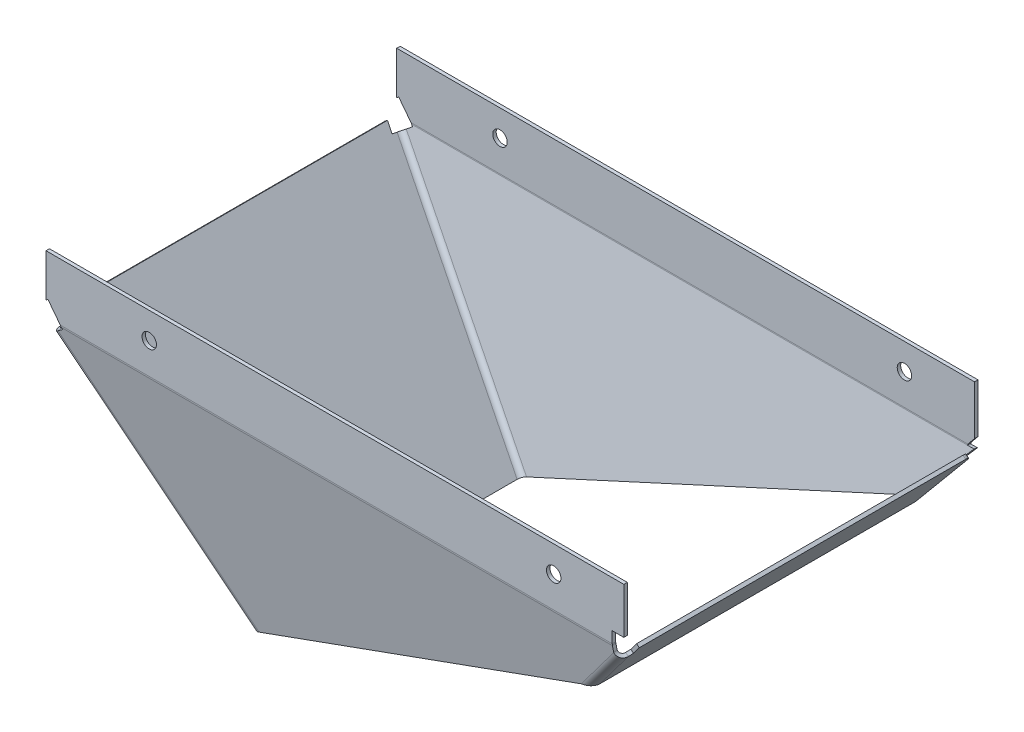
ISO-10303-21;
HEADER;
FILE_DESCRIPTION(('STEP AP214'),'2;1');
FILE_NAME('part.step','',(''),(''),'','','');
FILE_SCHEMA(('AUTOMOTIVE_DESIGN { 1 0 10303 214 1 1 1 1 }'));
ENDSEC;
DATA;
#1=APPLICATION_CONTEXT('core data for automotive mechanical design processes');
#2=APPLICATION_PROTOCOL_DEFINITION('international standard','automotive_design',2000,#1);
#3=PRODUCT_CONTEXT('',#1,'mechanical');
#4=PRODUCT('Part','Part','',(#3));
#5=PRODUCT_RELATED_PRODUCT_CATEGORY('part','',(#4));
#6=PRODUCT_DEFINITION_FORMATION('','',#4);
#7=PRODUCT_DEFINITION_CONTEXT('part definition',#1,'design');
#8=PRODUCT_DEFINITION('design','',#6,#7);
#9=PRODUCT_DEFINITION_SHAPE('','',#8);
#10=(LENGTH_UNIT() NAMED_UNIT(*) SI_UNIT(.MILLI.,.METRE.));
#11=(NAMED_UNIT(*) PLANE_ANGLE_UNIT() SI_UNIT($,.RADIAN.));
#12=(NAMED_UNIT(*) SI_UNIT($,.STERADIAN.) SOLID_ANGLE_UNIT());
#13=UNCERTAINTY_MEASURE_WITH_UNIT(LENGTH_MEASURE(1.E-05),#10,'distance_accuracy_value','');
#14=(GEOMETRIC_REPRESENTATION_CONTEXT(3) GLOBAL_UNCERTAINTY_ASSIGNED_CONTEXT((#13)) GLOBAL_UNIT_ASSIGNED_CONTEXT((#10,
#11,#12)) REPRESENTATION_CONTEXT('',''));
#15=CARTESIAN_POINT('',(0.,0.,0.));
#16=DIRECTION('',(0.,0.,1.));
#17=DIRECTION('',(1.,0.,0.));
#18=AXIS2_PLACEMENT_3D('',#15,#16,#17);
#19=CARTESIAN_POINT('',(-79.4150280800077,-76.7972491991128,-65.9961529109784));
#20=DIRECTION('',(0.786853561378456,0.605038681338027,-0.121612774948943));
#21=DIRECTION('',(-0.617139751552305,0.771424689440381,-0.155056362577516));
#22=AXIS2_PLACEMENT_3D('',#19,#20,#21);
#23=PLANE('',#22);
#24=DIRECTION('',(0.,0.197058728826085,0.980391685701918));
#25=VECTOR('',#24,1.);
#26=CARTESIAN_POINT('',(-120.354421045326,-25.6230079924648,-76.2821753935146));
#27=LINE('',#26,#25);
#28=CARTESIAN_POINT('',(-120.354421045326,-25.9223244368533,-77.7713119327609));
#29=VERTEX_POINT('',#28);
#30=CARTESIAN_POINT('',(-120.354421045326,-25.6230079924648,-76.2821753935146));
#31=VERTEX_POINT('',#30);
#32=EDGE_CURVE('E14',#29,#31,#27,.T.);
#33=ORIENTED_EDGE('',*,*,#32,.F.);
#34=DIRECTION('',(-0.617139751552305,0.771424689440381,-0.155056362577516));
#35=VECTOR('',#34,1.);
#36=CARTESIAN_POINT('',(-79.4150280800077,-77.0965656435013,-67.4852894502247));
#37=LINE('',#36,#35);
#38=CARTESIAN_POINT('',(-119.85547429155,-26.5460078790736,-77.6459515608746));
#39=VERTEX_POINT('',#38);
#40=EDGE_CURVE('E255',#39,#29,#37,.T.);
#41=ORIENTED_EDGE('',*,*,#40,.F.);
#42=DIRECTION('',(0.,0.197058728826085,0.980391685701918));
#43=VECTOR('',#42,1.);
#44=CARTESIAN_POINT('',(-119.85547429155,-26.2466914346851,-76.1568150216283));
#45=LINE('',#44,#43);
#46=CARTESIAN_POINT('',(-119.85547429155,-26.2466914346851,-76.1568150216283));
#47=VERTEX_POINT('',#46);
#48=EDGE_CURVE('E72',#39,#47,#45,.T.);
#49=ORIENTED_EDGE('',*,*,#48,.T.);
#50=DIRECTION('',(-0.617139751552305,0.771424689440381,-0.155056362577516));
#51=VECTOR('',#50,1.);
#52=CARTESIAN_POINT('',(-79.4150280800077,-76.7972491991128,-65.9961529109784));
#53=LINE('',#52,#51);
#54=EDGE_CURVE('E785',#47,#31,#53,.T.);
#55=ORIENTED_EDGE('',*,*,#54,.T.);
#56=EDGE_LOOP('',(#33,#41,#49,#55));
#57=FACE_BOUND('',#56,.T.);
#58=ADVANCED_FACE('F60',(#57),#23,.F.);
#59=CARTESIAN_POINT('',(-40.4404462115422,34.8182464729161,-88.4308675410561));
#60=DIRECTION('',(0.617139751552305,-0.771424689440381,0.155056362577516));
#61=DIRECTION('',(0.786853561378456,0.605038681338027,-0.121612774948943));
#62=AXIS2_PLACEMENT_3D('',#59,#60,#61);
#63=PLANE('',#62);
#64=ORIENTED_EDGE('',*,*,#48,.F.);
#65=DIRECTION('',(0.786853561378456,0.605038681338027,-0.121612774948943));
#66=VECTOR('',#65,1.);
#67=CARTESIAN_POINT('',(-40.4404462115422,34.5189300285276,-89.9200040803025));
#68=LINE('',#67,#66);
#69=CARTESIAN_POINT('',(-122.270142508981,-28.4027290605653,-77.2727506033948));
#70=VERTEX_POINT('',#69);
#71=EDGE_CURVE('E259',#70,#39,#68,.T.);
#72=ORIENTED_EDGE('',*,*,#71,.F.);
#73=DIRECTION('',(0.,0.197058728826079,0.980391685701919));
#74=VECTOR('',#73,1.);
#75=CARTESIAN_POINT('',(-122.270142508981,-28.1034126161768,-75.7836140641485));
#76=LINE('',#75,#74);
#77=CARTESIAN_POINT('',(-122.270142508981,-28.1034126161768,-75.7836140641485));
#78=VERTEX_POINT('',#77);
#79=EDGE_CURVE('E470',#70,#78,#76,.T.);
#80=ORIENTED_EDGE('',*,*,#79,.T.);
#81=DIRECTION('',(0.786853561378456,0.605038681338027,-0.121612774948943));
#82=VECTOR('',#81,1.);
#83=CARTESIAN_POINT('',(-40.4404462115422,34.8182464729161,-88.4308675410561));
#84=LINE('',#83,#82);
#85=EDGE_CURVE('E786',#78,#47,#84,.T.);
#86=ORIENTED_EDGE('',*,*,#85,.T.);
#87=EDGE_LOOP('',(#64,#72,#80,#86));
#88=FACE_BOUND('',#87,.T.);
#89=ADVANCED_FACE('F1030',(#88),#63,.F.);
#90=CARTESIAN_POINT('',(-122.270142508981,-27.6529363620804,-73.5424386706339));
#91=DIRECTION('',(-0.617139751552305,0.771424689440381,-0.155056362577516));
#92=DIRECTION('',(-0.78086880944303,-0.624695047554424,0.));
#93=AXIS2_PLACEMENT_3D('',#90,#91,#92);
#94=PLANE('',#93);
#95=ORIENTED_EDGE('',*,*,#79,.F.);
#96=CARTESIAN_POINT('',(-122.270142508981,-27.6529363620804,-73.5424386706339));
#97=DIRECTION('',(-0.617139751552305,0.771424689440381,-0.155056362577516));
#98=DIRECTION('',(-0.78086880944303,-0.624695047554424,0.));
#99=AXIS2_PLACEMENT_3D('',#96,#97,#98);
#100=CIRCLE('',#99,3.80492);
#101=CARTESIAN_POINT('',(-125.241285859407,-30.0298510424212,-73.5424386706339));
#102=VERTEX_POINT('',#101);
#103=EDGE_CURVE('E957',#70,#102,#100,.T.);
#104=ORIENTED_EDGE('',*,*,#103,.T.);
#105=DIRECTION('',(0.78086880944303,0.624695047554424,0.));
#106=VECTOR('',#105,1.);
#107=CARTESIAN_POINT('',(-124.055208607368,-29.0809892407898,-73.5424386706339));
#108=LINE('',#107,#106);
#109=CARTESIAN_POINT('',(-124.055208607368,-29.0809892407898,-73.5424386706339));
#110=VERTEX_POINT('',#109);
#111=EDGE_CURVE('E81',#102,#110,#108,.T.);
#112=ORIENTED_EDGE('',*,*,#111,.T.);
#113=CARTESIAN_POINT('',(-122.270142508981,-27.6529363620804,-73.5424386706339));
#114=DIRECTION('',(0.617139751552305,-0.771424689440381,0.155056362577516));
#115=DIRECTION('',(0.78086880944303,0.624695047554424,0.));
#116=AXIS2_PLACEMENT_3D('',#113,#114,#115);
#117=CIRCLE('',#116,2.286);
#118=EDGE_CURVE('E734',#78,#110,#117,.F.);
#119=ORIENTED_EDGE('',*,*,#118,.F.);
#120=EDGE_LOOP('',(#95,#104,#112,#119));
#121=FACE_BOUND('',#120,.T.);
#122=ADVANCED_FACE('F880',(#121),#94,.T.);
#123=CARTESIAN_POINT('',(-130.269714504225,-21.3128568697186,-10.16066211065));
#124=DIRECTION('',(0.617139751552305,-0.771424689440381,0.155056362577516));
#125=DIRECTION('',(0.0968629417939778,-0.121078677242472,-0.987905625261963));
#126=AXIS2_PLACEMENT_3D('',#123,#124,#125);
#127=PLANE('',#126);
#128=ORIENTED_EDGE('',*,*,#111,.F.);
#129=DIRECTION('',(0.0968629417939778,-0.121078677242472,-0.987905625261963));
#130=VECTOR('',#129,1.);
#131=CARTESIAN_POINT('',(-131.455791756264,-22.26171867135,-10.16066211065));
#132=LINE('',#131,#130);
#133=CARTESIAN_POINT('',(-125.436446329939,-29.7859004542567,-71.551996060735));
#134=VERTEX_POINT('',#133);
#135=EDGE_CURVE('E1014',#134,#102,#132,.T.);
#136=ORIENTED_EDGE('',*,*,#135,.F.);
#137=DIRECTION('',(0.78086880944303,0.624695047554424,0.));
#138=VECTOR('',#137,1.);
#139=CARTESIAN_POINT('',(-124.2503690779,-28.8370386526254,-71.551996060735));
#140=LINE('',#139,#138);
#141=CARTESIAN_POINT('',(-124.2503690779,-28.8370386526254,-71.551996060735));
#142=VERTEX_POINT('',#141);
#143=EDGE_CURVE('E466',#134,#142,#140,.T.);
#144=ORIENTED_EDGE('',*,*,#143,.T.);
#145=DIRECTION('',(0.0968629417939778,-0.121078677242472,-0.987905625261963));
#146=VECTOR('',#145,1.);
#147=CARTESIAN_POINT('',(-130.269714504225,-21.3128568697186,-10.16066211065));
#148=LINE('',#147,#146);
#149=EDGE_CURVE('E789',#142,#110,#148,.T.);
#150=ORIENTED_EDGE('',*,*,#149,.T.);
#151=EDGE_LOOP('',(#128,#136,#144,#150));
#152=FACE_BOUND('',#151,.T.);
#153=ADVANCED_FACE('F884',(#152),#127,.F.);
#154=CARTESIAN_POINT('',(-83.8099228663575,-79.3875964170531,-61.3913339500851));
#155=DIRECTION('',(0.0968629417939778,-0.121078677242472,-0.987905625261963));
#156=DIRECTION('',(-0.617139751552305,0.771424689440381,-0.155056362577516));
#157=AXIS2_PLACEMENT_3D('',#154,#155,#156);
#158=PLANE('',#157);
#159=ORIENTED_EDGE('',*,*,#143,.F.);
#160=DIRECTION('',(-0.617139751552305,0.771424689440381,-0.155056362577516));
#161=VECTOR('',#160,1.);
#162=CARTESIAN_POINT('',(-84.9960001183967,-80.3364582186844,-61.3913339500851));
#163=LINE('',#162,#161);
#164=CARTESIAN_POINT('',(-128.186077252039,-26.3488618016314,-72.2428408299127));
#165=VERTEX_POINT('',#164);
#166=EDGE_CURVE('E708',#134,#165,#163,.T.);
#167=ORIENTED_EDGE('',*,*,#166,.T.);
#168=DIRECTION('',(0.78086880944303,0.624695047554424,0.));
#169=VECTOR('',#168,1.);
#170=CARTESIAN_POINT('',(-127.,-25.4,-72.2428408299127));
#171=LINE('',#170,#169);
#172=CARTESIAN_POINT('',(-127.,-25.4,-72.2428408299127));
#173=VERTEX_POINT('',#172);
#174=EDGE_CURVE('E463',#165,#173,#171,.T.);
#175=ORIENTED_EDGE('',*,*,#174,.T.);
#176=DIRECTION('',(-0.617139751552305,0.771424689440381,-0.155056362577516));
#177=VECTOR('',#176,1.);
#178=CARTESIAN_POINT('',(-83.8099228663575,-79.3875964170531,-61.3913339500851));
#179=LINE('',#178,#177);
#180=EDGE_CURVE('E678',#142,#173,#179,.T.);
#181=ORIENTED_EDGE('',*,*,#180,.F.);
#182=EDGE_LOOP('',(#159,#167,#175,#181));
#183=FACE_BOUND('',#182,.T.);
#184=ADVANCED_FACE('F1040',(#183),#158,.T.);
#185=CARTESIAN_POINT('',(-127.,-25.4,76.327));
#186=DIRECTION('',(-0.624695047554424,0.78086880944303,0.));
#187=DIRECTION('',(0.,0.,1.));
#188=AXIS2_PLACEMENT_3D('',#185,#186,#187);
#189=PLANE('',#188);
#190=ORIENTED_EDGE('',*,*,#174,.F.);
#191=DIRECTION('',(0.,0.,1.));
#192=VECTOR('',#191,1.);
#193=CARTESIAN_POINT('',(-128.186077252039,-26.3488618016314,0.));
#194=LINE('',#193,#192);
#195=CARTESIAN_POINT('',(-128.186077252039,-26.3488618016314,72.2428408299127));
#196=VERTEX_POINT('',#195);
#197=EDGE_CURVE('E946',#165,#196,#194,.T.);
#198=ORIENTED_EDGE('',*,*,#197,.T.);
#199=DIRECTION('',(0.78086880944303,0.624695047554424,0.));
#200=VECTOR('',#199,1.);
#201=CARTESIAN_POINT('',(-127.,-25.4,72.2428408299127));
#202=LINE('',#201,#200);
#203=CARTESIAN_POINT('',(-127.,-25.4,72.2428408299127));
#204=VERTEX_POINT('',#203);
#205=EDGE_CURVE('E460',#196,#204,#202,.T.);
#206=ORIENTED_EDGE('',*,*,#205,.T.);
#207=DIRECTION('',(0.,0.,1.));
#208=VECTOR('',#207,1.);
#209=CARTESIAN_POINT('',(-127.,-25.4,76.327));
#210=LINE('',#209,#208);
#211=EDGE_CURVE('E894',#173,#204,#210,.T.);
#212=ORIENTED_EDGE('',*,*,#211,.F.);
#213=EDGE_LOOP('',(#190,#198,#206,#212));
#214=FACE_BOUND('',#213,.T.);
#215=ADVANCED_FACE('F1043',(#214),#189,.T.);
#216=CARTESIAN_POINT('',(-83.8099228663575,-79.3875964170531,61.391333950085));
#217=DIRECTION('',(0.0968629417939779,-0.121078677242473,0.987905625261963));
#218=DIRECTION('',(0.617139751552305,-0.771424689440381,-0.155056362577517));
#219=AXIS2_PLACEMENT_3D('',#216,#217,#218);
#220=PLANE('',#219);
#221=ORIENTED_EDGE('',*,*,#205,.F.);
#222=DIRECTION('',(0.617139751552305,-0.771424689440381,-0.155056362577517));
#223=VECTOR('',#222,1.);
#224=CARTESIAN_POINT('',(-84.9960001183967,-80.3364582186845,61.391333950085));
#225=LINE('',#224,#223);
#226=CARTESIAN_POINT('',(-125.436446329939,-29.7859004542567,71.551996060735));
#227=VERTEX_POINT('',#226);
#228=EDGE_CURVE('E257',#196,#227,#225,.T.);
#229=ORIENTED_EDGE('',*,*,#228,.T.);
#230=DIRECTION('',(0.78086880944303,0.624695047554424,0.));
#231=VECTOR('',#230,1.);
#232=CARTESIAN_POINT('',(-124.2503690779,-28.8370386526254,71.551996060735));
#233=LINE('',#232,#231);
#234=CARTESIAN_POINT('',(-124.2503690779,-28.8370386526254,71.551996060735));
#235=VERTEX_POINT('',#234);
#236=EDGE_CURVE('E457',#227,#235,#233,.T.);
#237=ORIENTED_EDGE('',*,*,#236,.T.);
#238=DIRECTION('',(0.617139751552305,-0.771424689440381,-0.155056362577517));
#239=VECTOR('',#238,1.);
#240=CARTESIAN_POINT('',(-83.8099228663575,-79.3875964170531,61.391333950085));
#241=LINE('',#240,#239);
#242=EDGE_CURVE('E779',#204,#235,#241,.T.);
#243=ORIENTED_EDGE('',*,*,#242,.F.);
#244=EDGE_LOOP('',(#221,#229,#237,#243));
#245=FACE_BOUND('',#244,.T.);
#246=ADVANCED_FACE('F1047',(#245),#220,.T.);
#247=CARTESIAN_POINT('',(-130.269714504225,-21.3128568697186,10.16066211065));
#248=DIRECTION('',(0.617139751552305,-0.771424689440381,-0.155056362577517));
#249=DIRECTION('',(-0.0968629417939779,0.121078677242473,-0.987905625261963));
#250=AXIS2_PLACEMENT_3D('',#247,#248,#249);
#251=PLANE('',#250);
#252=ORIENTED_EDGE('',*,*,#236,.F.);
#253=DIRECTION('',(-0.0968629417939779,0.121078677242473,-0.987905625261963));
#254=VECTOR('',#253,1.);
#255=CARTESIAN_POINT('',(-131.455791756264,-22.2617186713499,10.16066211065));
#256=LINE('',#255,#254);
#257=CARTESIAN_POINT('',(-125.241285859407,-30.0298510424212,73.5424386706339));
#258=VERTEX_POINT('',#257);
#259=EDGE_CURVE('E1005',#258,#227,#256,.T.);
#260=ORIENTED_EDGE('',*,*,#259,.F.);
#261=DIRECTION('',(0.780868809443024,0.624695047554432,0.));
#262=VECTOR('',#261,1.);
#263=CARTESIAN_POINT('',(-124.055208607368,-29.0809892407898,73.5424386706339));
#264=LINE('',#263,#262);
#265=CARTESIAN_POINT('',(-124.055208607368,-29.0809892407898,73.5424386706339));
#266=VERTEX_POINT('',#265);
#267=EDGE_CURVE('E454',#258,#266,#264,.T.);
#268=ORIENTED_EDGE('',*,*,#267,.T.);
#269=DIRECTION('',(-0.0968629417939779,0.121078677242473,-0.987905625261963));
#270=VECTOR('',#269,1.);
#271=CARTESIAN_POINT('',(-130.269714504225,-21.3128568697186,10.16066211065));
#272=LINE('',#271,#270);
#273=EDGE_CURVE('E772',#266,#235,#272,.T.);
#274=ORIENTED_EDGE('',*,*,#273,.T.);
#275=EDGE_LOOP('',(#252,#260,#268,#274));
#276=FACE_BOUND('',#275,.T.);
#277=ADVANCED_FACE('F1051',(#276),#251,.F.);
#278=CARTESIAN_POINT('',(-122.270142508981,-27.6529363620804,73.5424386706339));
#279=DIRECTION('',(-0.617139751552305,0.771424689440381,0.155056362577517));
#280=DIRECTION('',(-0.78086880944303,-0.624695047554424,0.));
#281=AXIS2_PLACEMENT_3D('',#278,#279,#280);
#282=PLANE('',#281);
#283=ORIENTED_EDGE('',*,*,#267,.F.);
#284=CARTESIAN_POINT('',(-122.270142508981,-27.6529363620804,73.5424386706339));
#285=DIRECTION('',(-0.617139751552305,0.771424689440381,0.155056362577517));
#286=DIRECTION('',(-0.78086880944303,-0.624695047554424,0.));
#287=AXIS2_PLACEMENT_3D('',#284,#285,#286);
#288=CIRCLE('',#287,3.80492);
#289=CARTESIAN_POINT('',(-122.270142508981,-28.4027290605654,77.2727506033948));
#290=VERTEX_POINT('',#289);
#291=EDGE_CURVE('E956',#258,#290,#288,.T.);
#292=ORIENTED_EDGE('',*,*,#291,.T.);
#293=DIRECTION('',(0.,0.197058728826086,-0.980391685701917));
#294=VECTOR('',#293,1.);
#295=CARTESIAN_POINT('',(-122.270142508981,-28.1034126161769,75.7836140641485));
#296=LINE('',#295,#294);
#297=CARTESIAN_POINT('',(-122.270142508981,-28.1034126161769,75.7836140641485));
#298=VERTEX_POINT('',#297);
#299=EDGE_CURVE('E451',#290,#298,#296,.T.);
#300=ORIENTED_EDGE('',*,*,#299,.T.);
#301=CARTESIAN_POINT('',(-122.270142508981,-27.6529363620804,73.5424386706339));
#302=DIRECTION('',(0.617139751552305,-0.771424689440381,-0.155056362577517));
#303=DIRECTION('',(0.78086880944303,0.624695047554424,0.));
#304=AXIS2_PLACEMENT_3D('',#301,#302,#303);
#305=CIRCLE('',#304,2.286);
#306=EDGE_CURVE('E745',#266,#298,#305,.F.);
#307=ORIENTED_EDGE('',*,*,#306,.F.);
#308=EDGE_LOOP('',(#283,#292,#300,#307));
#309=FACE_BOUND('',#308,.T.);
#310=ADVANCED_FACE('F1055',(#309),#282,.T.);
#311=CARTESIAN_POINT('',(-40.4404462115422,34.8182464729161,88.4308675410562));
#312=DIRECTION('',(0.617139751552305,-0.771424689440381,-0.155056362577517));
#313=DIRECTION('',(-0.786853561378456,-0.605038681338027,-0.121612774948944));
#314=AXIS2_PLACEMENT_3D('',#311,#312,#313);
#315=PLANE('',#314);
#316=ORIENTED_EDGE('',*,*,#299,.F.);
#317=DIRECTION('',(-0.786853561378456,-0.605038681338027,-0.121612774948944));
#318=VECTOR('',#317,1.);
#319=CARTESIAN_POINT('',(-40.4404462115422,34.5189300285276,89.9200040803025));
#320=LINE('',#319,#318);
#321=CARTESIAN_POINT('',(-119.85547429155,-26.5460078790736,77.6459515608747));
#322=VERTEX_POINT('',#321);
#323=EDGE_CURVE('E1002',#322,#290,#320,.T.);
#324=ORIENTED_EDGE('',*,*,#323,.F.);
#325=DIRECTION('',(0.,0.197058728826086,-0.980391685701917));
#326=VECTOR('',#325,1.);
#327=CARTESIAN_POINT('',(-119.85547429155,-26.2466914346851,76.1568150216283));
#328=LINE('',#327,#326);
#329=CARTESIAN_POINT('',(-119.85547429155,-26.2466914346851,76.1568150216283));
#330=VERTEX_POINT('',#329);
#331=EDGE_CURVE('E448',#322,#330,#328,.T.);
#332=ORIENTED_EDGE('',*,*,#331,.T.);
#333=DIRECTION('',(-0.786853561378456,-0.605038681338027,-0.121612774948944));
#334=VECTOR('',#333,1.);
#335=CARTESIAN_POINT('',(-40.4404462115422,34.8182464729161,88.4308675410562));
#336=LINE('',#335,#334);
#337=EDGE_CURVE('E768',#330,#298,#336,.T.);
#338=ORIENTED_EDGE('',*,*,#337,.T.);
#339=EDGE_LOOP('',(#316,#324,#332,#338));
#340=FACE_BOUND('',#339,.T.);
#341=ADVANCED_FACE('F1059',(#340),#315,.F.);
#342=CARTESIAN_POINT('',(-79.4150280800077,-76.7972491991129,65.9961529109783));
#343=DIRECTION('',(0.786853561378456,0.605038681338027,0.121612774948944));
#344=DIRECTION('',(0.617139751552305,-0.771424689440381,-0.155056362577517));
#345=AXIS2_PLACEMENT_3D('',#342,#343,#344);
#346=PLANE('',#345);
#347=ORIENTED_EDGE('',*,*,#331,.F.);
#348=DIRECTION('',(0.617139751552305,-0.771424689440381,-0.155056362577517));
#349=VECTOR('',#348,1.);
#350=CARTESIAN_POINT('',(-79.4150280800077,-77.0965656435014,67.4852894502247));
#351=LINE('',#350,#349);
#352=CARTESIAN_POINT('',(-120.354421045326,-25.9223244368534,77.7713119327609));
#353=VERTEX_POINT('',#352);
#354=EDGE_CURVE('E995',#353,#322,#351,.T.);
#355=ORIENTED_EDGE('',*,*,#354,.F.);
#356=DIRECTION('',(0.,0.197058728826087,-0.980391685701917));
#357=VECTOR('',#356,1.);
#358=CARTESIAN_POINT('',(-120.354421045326,-25.6230079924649,76.2821753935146));
#359=LINE('',#358,#357);
#360=CARTESIAN_POINT('',(-120.354421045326,-25.6230079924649,76.2821753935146));
#361=VERTEX_POINT('',#360);
#362=EDGE_CURVE('E445',#353,#361,#359,.T.);
#363=ORIENTED_EDGE('',*,*,#362,.T.);
#364=DIRECTION('',(0.617139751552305,-0.771424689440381,-0.155056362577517));
#365=VECTOR('',#364,1.);
#366=CARTESIAN_POINT('',(-79.4150280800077,-76.7972491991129,65.9961529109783));
#367=LINE('',#366,#365);
#368=EDGE_CURVE('E771',#361,#330,#367,.T.);
#369=ORIENTED_EDGE('',*,*,#368,.T.);
#370=EDGE_LOOP('',(#347,#355,#363,#369));
#371=FACE_BOUND('',#370,.T.);
#372=ADVANCED_FACE('F1063',(#371),#346,.F.);
#373=CARTESIAN_POINT('',(-118.561480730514,-27.4137071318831,73.5905237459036));
#374=CARTESIAN_POINT('',(-118.561480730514,-27.9100859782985,73.4907515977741));
#375=CARTESIAN_POINT('',(-118.561480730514,-28.406464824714,73.3909794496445));
#376=CARTESIAN_POINT('',(-118.561480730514,-28.9028436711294,73.291207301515));
#377=CARTESIAN_POINT('',(-118.561480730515,-28.3146596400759,78.0728745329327));
#378=CARTESIAN_POINT('',(-118.561480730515,-29.0105827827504,78.9658600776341));
#379=CARTESIAN_POINT('',(-118.561480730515,-29.7065059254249,79.8588456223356));
#380=CARTESIAN_POINT('',(-118.561480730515,-30.4024290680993,80.7518311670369));
#381=CARTESIAN_POINT('',(-122.147361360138,-23.8323088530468,78.9738270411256));
#382=CARTESIAN_POINT('',(-122.147361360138,-23.5354743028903,80.066356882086));
#383=CARTESIAN_POINT('',(-122.147361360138,-23.2386397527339,81.1588867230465));
#384=CARTESIAN_POINT('',(-122.147361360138,-22.9418052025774,82.2514165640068));
#385=CARTESIAN_POINT('',(-122.147361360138,-22.9313563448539,74.4914762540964));
#386=CARTESIAN_POINT('',(-122.147361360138,-22.4349774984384,74.5912484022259));
#387=CARTESIAN_POINT('',(-122.147361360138,-21.938598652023,74.6910205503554));
#388=CARTESIAN_POINT('',(-122.147361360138,-21.4422198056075,74.7907926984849));
#389=CARTESIAN_POINT('',(-122.147361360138,-22.030403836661,70.0091254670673));
#390=CARTESIAN_POINT('',(-122.147361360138,-21.3344806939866,69.1161399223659));
#391=CARTESIAN_POINT('',(-122.147361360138,-20.6385575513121,68.2231543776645));
#392=CARTESIAN_POINT('',(-122.147361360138,-19.9426344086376,67.3301688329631));
#393=CARTESIAN_POINT('',(-118.561480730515,-26.5127546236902,69.1081729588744));
#394=CARTESIAN_POINT('',(-118.561480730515,-26.8095891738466,68.015643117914));
#395=CARTESIAN_POINT('',(-118.561480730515,-27.1064237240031,66.9231132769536));
#396=CARTESIAN_POINT('',(-118.561480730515,-27.4032582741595,65.8305834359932));
#397=CARTESIAN_POINT('',(-118.561480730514,-27.4137071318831,73.5905237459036));
#398=CARTESIAN_POINT('',(-118.561480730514,-27.9100859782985,73.4907515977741));
#399=CARTESIAN_POINT('',(-118.561480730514,-28.406464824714,73.3909794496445));
#400=CARTESIAN_POINT('',(-118.561480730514,-28.9028436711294,73.291207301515));
#401=(BOUNDED_SURFACE() B_SPLINE_SURFACE(3,3,((#373,#374,#375,#376),(#377,#378,#379,#380),(#381,
#382,#383,#384),(#385,#386,#387,#388),(#389,#390,#391,#392),(#393,#394,#395,#396),(#397,#398,
#399,#400)),.UNSPECIFIED.,.T.,.F.,.F.) B_SPLINE_SURFACE_WITH_KNOTS((4,3,4),(4,4),(0.,0.5,1.),
(0.,1.),.UNSPECIFIED.) GEOMETRIC_REPRESENTATION_ITEM() RATIONAL_B_SPLINE_SURFACE(((1.,1.,1.,1.),
(0.333333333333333,0.333333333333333,0.333333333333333,0.333333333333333),(0.333333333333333,
0.333333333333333,0.333333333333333,0.333333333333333),(1.,1.,1.,1.),(0.333333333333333,
0.333333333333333,0.333333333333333,0.333333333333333),(0.333333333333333,0.333333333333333,
0.333333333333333,0.333333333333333),(1.,1.,1.,1.))) REPRESENTATION_ITEM('') SURFACE());
#402=CARTESIAN_POINT('',(-120.354421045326,-25.1725317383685,74.041));
#403=DIRECTION('',(-0.90459969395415,-0.417903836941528,-0.0839986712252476));
#404=DIRECTION('',(0.426262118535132,-0.886862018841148,-0.178259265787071));
#405=AXIS2_PLACEMENT_3D('',#402,#403,#404);
#406=ELLIPSE('',#405,4.20619200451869,3.80492);
#407=CARTESIAN_POINT('',(-120.707735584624,-25.1725317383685,77.84592));
#408=VERTEX_POINT('',#407);
#409=EDGE_CURVE('E964',#353,#408,#406,.T.);
#410=DIRECTION('',(0.,0.,-1.));
#411=VECTOR('',#410,1.);
#412=CARTESIAN_POINT('',(-120.707735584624,-25.1725317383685,76.327));
#413=LINE('',#412,#411);
#414=CARTESIAN_POINT('',(-120.707735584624,-25.1725317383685,76.327));
#415=VERTEX_POINT('',#414);
#416=EDGE_CURVE('E442',#408,#415,#413,.T.);
#417=CARTESIAN_POINT('',(-120.354421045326,-25.1725317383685,74.041));
#418=DIRECTION('',(-0.786853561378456,-0.605038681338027,-0.121612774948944));
#419=DIRECTION('',(0.617139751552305,-0.771424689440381,-0.155056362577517));
#420=AXIS2_PLACEMENT_3D('',#417,#418,#419);
#421=ELLIPSE('',#420,2.90524198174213,2.286);
#422=EDGE_CURVE('E756',#361,#415,#421,.T.);
#423=ORIENTED_EDGE('',*,*,#362,.F.);
#424=ORIENTED_EDGE('',*,*,#409,.T.);
#425=ORIENTED_EDGE('',*,*,#416,.T.);
#426=ORIENTED_EDGE('',*,*,#422,.F.);
#427=EDGE_LOOP('',(#423,#424,#425,#426));
#428=FACE_BOUND('',#427,.T.);
#429=ADVANCED_FACE('F1067',(#428),#401,.F.);
#430=CARTESIAN_POINT('',(-122.935816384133,-22.2749098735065,76.327));
#431=DIRECTION('',(0.792737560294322,0.609563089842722,0.));
#432=DIRECTION('',(-0.609563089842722,0.792737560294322,0.));
#433=AXIS2_PLACEMENT_3D('',#430,#431,#432);
#434=PLANE('',#433);
#435=ORIENTED_EDGE('',*,*,#416,.F.);
#436=DIRECTION('',(-0.609563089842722,0.792737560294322,0.));
#437=VECTOR('',#436,1.);
#438=CARTESIAN_POINT('',(-122.935816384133,-22.2749098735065,77.84592));
#439=LINE('',#438,#437);
#440=CARTESIAN_POINT('',(-126.136374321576,-18.1125802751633,77.84592));
#441=VERTEX_POINT('',#440);
#442=EDGE_CURVE('E994',#408,#441,#439,.T.);
#443=ORIENTED_EDGE('',*,*,#442,.T.);
#444=DIRECTION('',(0.,0.,-1.));
#445=VECTOR('',#444,1.);
#446=CARTESIAN_POINT('',(-126.136374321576,-18.1125802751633,76.327));
#447=LINE('',#446,#445);
#448=CARTESIAN_POINT('',(-126.136374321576,-18.1125802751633,76.327));
#449=VERTEX_POINT('',#448);
#450=EDGE_CURVE('E439',#441,#449,#447,.T.);
#451=ORIENTED_EDGE('',*,*,#450,.T.);
#452=DIRECTION('',(-0.609563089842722,0.792737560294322,0.));
#453=VECTOR('',#452,1.);
#454=CARTESIAN_POINT('',(-122.935816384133,-22.2749098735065,76.327));
#455=LINE('',#454,#453);
#456=EDGE_CURVE('E556',#415,#449,#455,.T.);
#457=ORIENTED_EDGE('',*,*,#456,.F.);
#458=EDGE_LOOP('',(#435,#443,#451,#457));
#459=FACE_BOUND('',#458,.T.);
#460=ADVANCED_FACE('F1073',(#459),#434,.F.);
#461=CARTESIAN_POINT('',(-130.21781423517,-21.3777322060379,76.327));
#462=DIRECTION('',(-0.624695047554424,0.78086880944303,0.));
#463=DIRECTION('',(-0.78086880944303,-0.624695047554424,0.));
#464=AXIS2_PLACEMENT_3D('',#461,#462,#463);
#465=PLANE('',#464);
#466=ORIENTED_EDGE('',*,*,#450,.F.);
#467=DIRECTION('',(-0.78086880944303,-0.624695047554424,0.));
#468=VECTOR('',#467,1.);
#469=CARTESIAN_POINT('',(-130.21781423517,-21.3777322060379,77.84592));
#470=LINE('',#469,#468);
#471=CARTESIAN_POINT('',(-127.,-18.8034808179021,77.84592));
#472=VERTEX_POINT('',#471);
#473=EDGE_CURVE('E991',#441,#472,#470,.T.);
#474=ORIENTED_EDGE('',*,*,#473,.T.);
#475=DIRECTION('',(0.,0.,-1.));
#476=VECTOR('',#475,1.);
#477=CARTESIAN_POINT('',(-127.,-18.8034808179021,76.327));
#478=LINE('',#477,#476);
#479=CARTESIAN_POINT('',(-127.,-18.8034808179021,76.327));
#480=VERTEX_POINT('',#479);
#481=EDGE_CURVE('E436',#472,#480,#478,.T.);
#482=ORIENTED_EDGE('',*,*,#481,.T.);
#483=DIRECTION('',(-0.78086880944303,-0.624695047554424,0.));
#484=VECTOR('',#483,1.);
#485=CARTESIAN_POINT('',(-130.21781423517,-21.3777322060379,76.327));
#486=LINE('',#485,#484);
#487=EDGE_CURVE('E767',#449,#480,#486,.T.);
#488=ORIENTED_EDGE('',*,*,#487,.F.);
#489=EDGE_LOOP('',(#466,#474,#482,#488));
#490=FACE_BOUND('',#489,.T.);
#491=ADVANCED_FACE('F1082',(#490),#465,.F.);
#492=CARTESIAN_POINT('',(-127.,-25.4,76.327));
#493=DIRECTION('',(1.,0.,0.));
#494=DIRECTION('',(0.,1.,0.));
#495=AXIS2_PLACEMENT_3D('',#492,#493,#494);
#496=PLANE('',#495);
#497=ORIENTED_EDGE('',*,*,#481,.F.);
#498=DIRECTION('',(0.,1.,0.));
#499=VECTOR('',#498,1.);
#500=CARTESIAN_POINT('',(-127.,-25.4,77.84592));
#501=LINE('',#500,#499);
#502=CARTESIAN_POINT('',(-127.,0.,77.84592));
#503=VERTEX_POINT('',#502);
#504=EDGE_CURVE('E969',#472,#503,#501,.T.);
#505=ORIENTED_EDGE('',*,*,#504,.T.);
#506=DIRECTION('',(0.,0.,-1.));
#507=VECTOR('',#506,1.);
#508=CARTESIAN_POINT('',(-127.,0.,76.327));
#509=LINE('',#508,#507);
#510=CARTESIAN_POINT('',(-127.,0.,76.327));
#511=VERTEX_POINT('',#510);
#512=EDGE_CURVE('E433',#503,#511,#509,.T.);
#513=ORIENTED_EDGE('',*,*,#512,.T.);
#514=DIRECTION('',(0.,1.,0.));
#515=VECTOR('',#514,1.);
#516=CARTESIAN_POINT('',(-127.,-25.4,76.327));
#517=LINE('',#516,#515);
#518=EDGE_CURVE('E911',#480,#511,#517,.T.);
#519=ORIENTED_EDGE('',*,*,#518,.F.);
#520=EDGE_LOOP('',(#497,#505,#513,#519));
#521=FACE_BOUND('',#520,.T.);
#522=ADVANCED_FACE('F1086',(#521),#496,.F.);
#523=CARTESIAN_POINT('',(-127.,0.,76.327));
#524=DIRECTION('',(0.,-1.,0.));
#525=DIRECTION('',(1.,0.,0.));
#526=AXIS2_PLACEMENT_3D('',#523,#524,#525);
#527=PLANE('',#526);
#528=ORIENTED_EDGE('',*,*,#512,.F.);
#529=DIRECTION('',(1.,0.,0.));
#530=VECTOR('',#529,1.);
#531=CARTESIAN_POINT('',(-127.,0.,77.84592));
#532=LINE('',#531,#530);
#533=CARTESIAN_POINT('',(127.,0.,77.84592));
#534=VERTEX_POINT('',#533);
#535=EDGE_CURVE('E960',#503,#534,#532,.T.);
#536=ORIENTED_EDGE('',*,*,#535,.T.);
#537=DIRECTION('',(0.,0.,-1.));
#538=VECTOR('',#537,1.);
#539=CARTESIAN_POINT('',(127.,0.,76.327));
#540=LINE('',#539,#538);
#541=CARTESIAN_POINT('',(127.,0.,76.327));
#542=VERTEX_POINT('',#541);
#543=EDGE_CURVE('E430',#534,#542,#540,.T.);
#544=ORIENTED_EDGE('',*,*,#543,.T.);
#545=DIRECTION('',(1.,0.,0.));
#546=VECTOR('',#545,1.);
#547=CARTESIAN_POINT('',(-127.,0.,76.327));
#548=LINE('',#547,#546);
#549=EDGE_CURVE('E905',#511,#542,#548,.T.);
#550=ORIENTED_EDGE('',*,*,#549,.F.);
#551=EDGE_LOOP('',(#528,#536,#544,#550));
#552=FACE_BOUND('',#551,.T.);
#553=ADVANCED_FACE('F1090',(#552),#527,.F.);
#554=CARTESIAN_POINT('',(127.,-25.4,76.327));
#555=DIRECTION('',(1.,0.,0.));
#556=DIRECTION('',(0.,1.,0.));
#557=AXIS2_PLACEMENT_3D('',#554,#555,#556);
#558=PLANE('',#557);
#559=ORIENTED_EDGE('',*,*,#543,.F.);
#560=DIRECTION('',(0.,1.,0.));
#561=VECTOR('',#560,1.);
#562=CARTESIAN_POINT('',(127.,-25.4,77.84592));
#563=LINE('',#562,#561);
#564=CARTESIAN_POINT('',(127.,-20.209505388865,77.84592));
#565=VERTEX_POINT('',#564);
#566=EDGE_CURVE('E984',#565,#534,#563,.T.);
#567=ORIENTED_EDGE('',*,*,#566,.F.);
#568=DIRECTION('',(0.,0.,-1.));
#569=VECTOR('',#568,1.);
#570=CARTESIAN_POINT('',(127.,-20.209505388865,76.327));
#571=LINE('',#570,#569);
#572=CARTESIAN_POINT('',(127.,-20.209505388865,76.327));
#573=VERTEX_POINT('',#572);
#574=EDGE_CURVE('E427',#565,#573,#571,.T.);
#575=ORIENTED_EDGE('',*,*,#574,.T.);
#576=DIRECTION('',(0.,1.,0.));
#577=VECTOR('',#576,1.);
#578=CARTESIAN_POINT('',(127.,-25.4,76.327));
#579=LINE('',#578,#577);
#580=EDGE_CURVE('E908',#573,#542,#579,.T.);
#581=ORIENTED_EDGE('',*,*,#580,.T.);
#582=EDGE_LOOP('',(#559,#567,#575,#581));
#583=FACE_BOUND('',#582,.T.);
#584=ADVANCED_FACE('F1094',(#583),#558,.T.);
#585=CARTESIAN_POINT('',(-127.,-20.209505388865,76.327));
#586=DIRECTION('',(0.,1.,0.));
#587=DIRECTION('',(-1.,0.,0.));
#588=AXIS2_PLACEMENT_3D('',#585,#586,#587);
#589=PLANE('',#588);
#590=ORIENTED_EDGE('',*,*,#574,.F.);
#591=DIRECTION('',(1.,0.,0.));
#592=VECTOR('',#591,1.);
#593=CARTESIAN_POINT('',(-127.,-20.209505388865,77.84592));
#594=LINE('',#593,#592);
#595=CARTESIAN_POINT('',(121.911282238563,-20.209505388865,77.84592));
#596=VERTEX_POINT('',#595);
#597=EDGE_CURVE('E322',#565,#596,#594,.F.);
#598=ORIENTED_EDGE('',*,*,#597,.T.);
#599=DIRECTION('',(0.,0.,-1.));
#600=VECTOR('',#599,1.);
#601=CARTESIAN_POINT('',(121.911282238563,-20.209505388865,76.327));
#602=LINE('',#601,#600);
#603=CARTESIAN_POINT('',(121.911282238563,-20.209505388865,76.327));
#604=VERTEX_POINT('',#603);
#605=EDGE_CURVE('E424',#596,#604,#602,.T.);
#606=ORIENTED_EDGE('',*,*,#605,.T.);
#607=DIRECTION('',(-1.,0.,0.));
#608=VECTOR('',#607,1.);
#609=CARTESIAN_POINT('',(-127.,-20.209505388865,76.327));
#610=LINE('',#609,#608);
#611=EDGE_CURVE('E800',#573,#604,#610,.T.);
#612=ORIENTED_EDGE('',*,*,#611,.F.);
#613=EDGE_LOOP('',(#590,#598,#606,#612));
#614=FACE_BOUND('',#613,.T.);
#615=ADVANCED_FACE('F1098',(#614),#589,.F.);
#616=CARTESIAN_POINT('',(121.911282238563,-25.4,76.327));
#617=DIRECTION('',(-1.,0.,0.));
#618=DIRECTION('',(0.,-1.,0.));
#619=AXIS2_PLACEMENT_3D('',#616,#617,#618);
#620=PLANE('',#619);
#621=ORIENTED_EDGE('',*,*,#605,.F.);
#622=DIRECTION('',(0.,1.,0.));
#623=VECTOR('',#622,1.);
#624=CARTESIAN_POINT('',(121.911282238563,-25.4,77.84592));
#625=LINE('',#624,#623);
#626=CARTESIAN_POINT('',(121.911282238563,-25.1725317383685,77.84592));
#627=VERTEX_POINT('',#626);
#628=EDGE_CURVE('E976',#596,#627,#625,.F.);
#629=ORIENTED_EDGE('',*,*,#628,.T.);
#630=DIRECTION('',(0.,0.,-1.));
#631=VECTOR('',#630,1.);
#632=CARTESIAN_POINT('',(121.911282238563,-25.1725317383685,76.327));
#633=LINE('',#632,#631);
#634=CARTESIAN_POINT('',(121.911282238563,-25.1725317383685,76.327));
#635=VERTEX_POINT('',#634);
#636=EDGE_CURVE('E421',#627,#635,#633,.T.);
#637=ORIENTED_EDGE('',*,*,#636,.T.);
#638=DIRECTION('',(0.,-1.,0.));
#639=VECTOR('',#638,1.);
#640=CARTESIAN_POINT('',(121.911282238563,-25.4,76.327));
#641=LINE('',#640,#639);
#642=EDGE_CURVE('E797',#604,#635,#641,.T.);
#643=ORIENTED_EDGE('',*,*,#642,.F.);
#644=EDGE_LOOP('',(#621,#629,#637,#643));
#645=FACE_BOUND('',#644,.T.);
#646=ADVANCED_FACE('F1102',(#645),#620,.F.);
#647=CARTESIAN_POINT('',(121.911282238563,-25.1725317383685,74.041));
#648=DIRECTION('',(-1.,0.,0.));
#649=DIRECTION('',(0.,0.,1.));
#650=AXIS2_PLACEMENT_3D('',#647,#648,#649);
#651=PLANE('',#650);
#652=ORIENTED_EDGE('',*,*,#636,.F.);
#653=CARTESIAN_POINT('',(121.911282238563,-25.1725317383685,74.041));
#654=DIRECTION('',(1.,0.,0.));
#655=DIRECTION('',(0.,1.,0.));
#656=AXIS2_PLACEMENT_3D('',#653,#654,#655);
#657=CIRCLE('',#656,3.80492);
#658=CARTESIAN_POINT('',(121.911282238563,-25.9223244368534,77.7713119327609));
#659=VERTEX_POINT('',#658);
#660=EDGE_CURVE('E977',#627,#659,#657,.T.);
#661=ORIENTED_EDGE('',*,*,#660,.T.);
#662=DIRECTION('',(0.,0.197058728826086,-0.980391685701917));
#663=VECTOR('',#662,1.);
#664=CARTESIAN_POINT('',(121.911282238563,-25.6230079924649,76.2821753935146));
#665=LINE('',#664,#663);
#666=CARTESIAN_POINT('',(121.911282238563,-25.6230079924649,76.2821753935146));
#667=VERTEX_POINT('',#666);
#668=EDGE_CURVE('E413',#659,#667,#665,.T.);
#669=ORIENTED_EDGE('',*,*,#668,.T.);
#670=CARTESIAN_POINT('',(121.911282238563,-25.1725317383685,74.041));
#671=DIRECTION('',(1.,0.,0.));
#672=DIRECTION('',(0.,0.,-1.));
#673=AXIS2_PLACEMENT_3D('',#670,#671,#672);
#674=CIRCLE('',#673,2.286);
#675=EDGE_CURVE('E748',#635,#667,#674,.T.);
#676=ORIENTED_EDGE('',*,*,#675,.F.);
#677=EDGE_LOOP('',(#652,#661,#669,#676));
#678=FACE_BOUND('',#677,.T.);
#679=ADVANCED_FACE('F1105',(#678),#651,.F.);
#680=CARTESIAN_POINT('',(121.911282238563,-15.7323112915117,78.2702054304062));
#681=DIRECTION('',(-1.,0.,0.));
#682=DIRECTION('',(0.,0.980391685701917,0.197058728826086));
#683=AXIS2_PLACEMENT_3D('',#680,#681,#682);
#684=PLANE('',#683);
#685=ORIENTED_EDGE('',*,*,#668,.F.);
#686=DIRECTION('',(0.,0.980391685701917,0.197058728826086));
#687=VECTOR('',#686,1.);
#688=CARTESIAN_POINT('',(121.911282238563,-16.0316277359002,79.7593419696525));
#689=LINE('',#688,#687);
#690=CARTESIAN_POINT('',(121.911282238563,-28.8513043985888,77.1825869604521));
#691=VERTEX_POINT('',#690);
#692=EDGE_CURVE('E319',#691,#659,#689,.T.);
#693=ORIENTED_EDGE('',*,*,#692,.F.);
#694=CARTESIAN_POINT('',(121.911282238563,-28.5519879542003,75.6934504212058));
#695=CARTESIAN_POINT('',(121.911282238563,-28.8513043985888,77.1825869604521));
#696=B_SPLINE_CURVE_WITH_KNOTS('',1,(#694,#695),.UNSPECIFIED.,.F.,.F.,(2,2),(0.,1.),.UNSPECIFIED.);
#697=CARTESIAN_POINT('',(121.911282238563,-28.5519879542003,75.6934504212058));
#698=VERTEX_POINT('',#697);
#699=EDGE_CURVE('E399',#691,#698,#696,.F.);
#700=ORIENTED_EDGE('',*,*,#699,.T.);
#701=DIRECTION('',(0.,0.980391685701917,0.197058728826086));
#702=VECTOR('',#701,1.);
#703=CARTESIAN_POINT('',(121.911282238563,-15.7323112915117,78.2702054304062));
#704=LINE('',#703,#702);
#705=EDGE_CURVE('E804',#698,#667,#704,.T.);
#706=ORIENTED_EDGE('',*,*,#705,.T.);
#707=EDGE_LOOP('',(#685,#693,#700,#706));
#708=FACE_BOUND('',#707,.T.);
#709=ADVANCED_FACE('F352',(#708),#684,.F.);
#710=CARTESIAN_POINT('',(124.51094550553,-30.9427764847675,73.3589406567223));
#711=CARTESIAN_POINT('',(124.482688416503,-30.9780978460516,73.5674498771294));
#712=CARTESIAN_POINT('',(124.438509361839,-31.0041860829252,73.7923447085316));
#713=CARTESIAN_POINT('',(124.312342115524,-31.0246113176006,74.2560985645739));
#714=CARTESIAN_POINT('',(124.230286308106,-31.0188902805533,74.4949110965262));
#715=CARTESIAN_POINT('',(124.029632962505,-30.967718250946,74.9650911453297));
#716=CARTESIAN_POINT('',(123.911048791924,-30.9222462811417,75.1963010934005));
#717=CARTESIAN_POINT('',(123.646888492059,-30.7904234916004,75.6309350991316));
#718=CARTESIAN_POINT('',(123.501394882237,-30.7041109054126,75.8342209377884));
#719=CARTESIAN_POINT('',(123.199751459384,-30.496069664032,76.1985508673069));
#720=CARTESIAN_POINT('',(123.043722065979,-30.3744240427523,76.3595287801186));
#721=CARTESIAN_POINT('',(122.740939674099,-30.105893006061,76.6339214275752));
#722=CARTESIAN_POINT('',(122.594298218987,-29.9591024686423,76.7473642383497));
#723=CARTESIAN_POINT('',(122.198084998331,-29.498995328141,77.0230007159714));
#724=CARTESIAN_POINT('',(121.994049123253,-29.1664363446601,77.1192454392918));
#725=CARTESIAN_POINT('',(121.911282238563,-28.8513043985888,77.1825869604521));
#726=CARTESIAN_POINT('',(123.324868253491,-29.9939146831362,73.3589406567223));
#727=CARTESIAN_POINT('',(123.304847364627,-30.0189407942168,73.4834486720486));
#728=CARTESIAN_POINT('',(123.275220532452,-30.0384696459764,73.6177906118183));
#729=CARTESIAN_POINT('',(123.194070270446,-30.0574272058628,73.8950705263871));
#730=CARTESIAN_POINT('',(123.142505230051,-30.0568222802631,74.0379800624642));
#731=CARTESIAN_POINT('',(123.019131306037,-30.0296045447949,74.3197559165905));
#732=CARTESIAN_POINT('',(122.947330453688,-30.0029791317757,74.4585275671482));
#733=CARTESIAN_POINT('',(122.790115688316,-29.9219135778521,74.7200312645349));
#734=CARTESIAN_POINT('',(122.704751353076,-29.8674964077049,74.842680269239));
#735=CARTESIAN_POINT('',(122.531117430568,-29.7330127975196,75.0634780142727));
#736=CARTESIAN_POINT('',(122.442920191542,-29.6529962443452,75.1615869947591));
#737=CARTESIAN_POINT('',(122.276489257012,-29.4723111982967,75.3303320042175));
#738=CARTESIAN_POINT('',(122.198322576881,-29.371699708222,75.400984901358));
#739=CARTESIAN_POINT('',(121.998009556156,-29.048101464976,75.576067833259));
#740=CARTESIAN_POINT('',(121.911282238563,-28.8037491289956,75.6428464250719));
#741=CARTESIAN_POINT('',(121.911282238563,-28.5519879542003,75.6934504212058));
#742=B_SPLINE_SURFACE_WITH_KNOTS('',1,3,((#710,#711,#712,#713,#714,#715,#716,#717,#718,#719,
#720,#721,#722,#723,#724,#725),(#726,#727,#728,#729,#730,#731,#732,#733,#734,#735,#736,#737,
#738,#739,#740,#741)),.UNSPECIFIED.,.F.,.F.,.F.,(2,2),(4,2,2,2,2,2,2,4),(0.,1.),(0.,0.125,0.25,
0.375,0.5,0.625,0.75,1.),.UNSPECIFIED.);
#743=CARTESIAN_POINT('',(121.911282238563,-28.8513043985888,77.1825869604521));
#744=CARTESIAN_POINT('',(121.994049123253,-29.1664363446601,77.1192454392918));
#745=CARTESIAN_POINT('',(122.198084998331,-29.498995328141,77.0230007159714));
#746=CARTESIAN_POINT('',(122.594298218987,-29.9591024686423,76.7473642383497));
#747=CARTESIAN_POINT('',(122.740939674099,-30.105893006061,76.6339214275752));
#748=CARTESIAN_POINT('',(123.043722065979,-30.3744240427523,76.3595287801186));
#749=CARTESIAN_POINT('',(123.199751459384,-30.496069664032,76.1985508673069));
#750=CARTESIAN_POINT('',(123.501394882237,-30.7041109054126,75.8342209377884));
#751=CARTESIAN_POINT('',(123.646888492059,-30.7904234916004,75.6309350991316));
#752=CARTESIAN_POINT('',(123.911048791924,-30.9222462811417,75.1963010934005));
#753=CARTESIAN_POINT('',(124.029632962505,-30.967718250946,74.9650911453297));
#754=CARTESIAN_POINT('',(124.230286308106,-31.0188902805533,74.4949110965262));
#755=CARTESIAN_POINT('',(124.312342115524,-31.0246113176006,74.2560985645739));
#756=CARTESIAN_POINT('',(124.438509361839,-31.0041860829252,73.7923447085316));
#757=CARTESIAN_POINT('',(124.482688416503,-30.9780978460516,73.5674498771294));
#758=CARTESIAN_POINT('',(124.51094550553,-30.9427764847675,73.3589406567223));
#759=B_SPLINE_CURVE_WITH_KNOTS('',3,(#743,#744,#745,#746,#747,#748,#749,#750,#751,#752,#753,
#754,#755,#756,#757,#758),.UNSPECIFIED.,.F.,.F.,(4,2,2,2,2,2,2,4),(0.,0.25,0.375,0.5,0.625,0.75,
0.875,1.),.UNSPECIFIED.);
#760=CARTESIAN_POINT('',(124.51094550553,-30.9427764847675,73.3589406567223));
#761=VERTEX_POINT('',#760);
#762=EDGE_CURVE('E250',#691,#761,#759,.T.);
#763=CARTESIAN_POINT('',(124.51094550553,-30.9427764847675,73.3589406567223));
#764=CARTESIAN_POINT('',(123.324868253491,-29.9939146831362,73.3589406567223));
#765=B_SPLINE_CURVE_WITH_KNOTS('',1,(#763,#764),.UNSPECIFIED.,.F.,.F.,(2,2),(0.,1.),.UNSPECIFIED.);
#766=CARTESIAN_POINT('',(123.324868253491,-29.9939146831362,73.3589406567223));
#767=VERTEX_POINT('',#766);
#768=EDGE_CURVE('E384',#761,#767,#765,.T.);
#769=CARTESIAN_POINT('',(123.324868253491,-29.9939146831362,73.3589406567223));
#770=CARTESIAN_POINT('',(123.304847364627,-30.0189407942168,73.4834486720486));
#771=CARTESIAN_POINT('',(123.275220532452,-30.0384696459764,73.6177906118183));
#772=CARTESIAN_POINT('',(123.194070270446,-30.0574272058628,73.8950705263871));
#773=CARTESIAN_POINT('',(123.142505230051,-30.0568222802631,74.0379800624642));
#774=CARTESIAN_POINT('',(123.019131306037,-30.0296045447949,74.3197559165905));
#775=CARTESIAN_POINT('',(122.947330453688,-30.0029791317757,74.4585275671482));
#776=CARTESIAN_POINT('',(122.790115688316,-29.9219135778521,74.7200312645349));
#777=CARTESIAN_POINT('',(122.704751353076,-29.8674964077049,74.842680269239));
#778=CARTESIAN_POINT('',(122.531117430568,-29.7330127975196,75.0634780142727));
#779=CARTESIAN_POINT('',(122.442920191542,-29.6529962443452,75.1615869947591));
#780=CARTESIAN_POINT('',(122.276489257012,-29.4723111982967,75.3303320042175));
#781=CARTESIAN_POINT('',(122.198322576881,-29.371699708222,75.400984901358));
#782=CARTESIAN_POINT('',(121.998009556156,-29.048101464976,75.576067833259));
#783=CARTESIAN_POINT('',(121.911282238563,-28.8037491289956,75.6428464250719));
#784=CARTESIAN_POINT('',(121.911282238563,-28.5519879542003,75.6934504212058));
#785=B_SPLINE_CURVE_WITH_KNOTS('',3,(#769,#770,#771,#772,#773,#774,#775,#776,#777,#778,#779,
#780,#781,#782,#783,#784),.UNSPECIFIED.,.F.,.F.,(4,2,2,2,2,2,2,4),(0.,0.125,0.25,0.375,0.5,
0.625,0.75,1.),.UNSPECIFIED.);
#786=EDGE_CURVE('E331',#698,#767,#785,.F.);
#787=ORIENTED_EDGE('',*,*,#699,.F.);
#788=ORIENTED_EDGE('',*,*,#762,.T.);
#789=ORIENTED_EDGE('',*,*,#768,.T.);
#790=ORIENTED_EDGE('',*,*,#786,.F.);
#791=EDGE_LOOP('',(#787,#788,#789,#790));
#792=FACE_BOUND('',#791,.T.);
#793=ADVANCED_FACE('F339',(#792),#742,.T.);
#794=CARTESIAN_POINT('',(132.306542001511,-18.7668224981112,17.5027606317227));
#795=DIRECTION('',(-0.604974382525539,-0.756217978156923,-0.249279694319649));
#796=DIRECTION('',(-0.155723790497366,-0.194654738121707,0.968431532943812));
#797=AXIS2_PLACEMENT_3D('',#794,#795,#796);
#798=PLANE('',#797);
#799=ORIENTED_EDGE('',*,*,#768,.F.);
#800=DIRECTION('',(-0.155723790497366,-0.194654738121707,0.968431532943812));
#801=VECTOR('',#800,1.);
#802=CARTESIAN_POINT('',(133.49261925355,-19.7156842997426,17.5027606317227));
#803=LINE('',#802,#801);
#804=CARTESIAN_POINT('',(124.826158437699,-30.5487603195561,71.3986612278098));
#805=VERTEX_POINT('',#804);
#806=EDGE_CURVE('E705',#805,#761,#803,.T.);
#807=ORIENTED_EDGE('',*,*,#806,.F.);
#808=DIRECTION('',(-0.78086880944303,0.624695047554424,0.));
#809=VECTOR('',#808,1.);
#810=CARTESIAN_POINT('',(123.64008118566,-29.5998985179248,71.3986612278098));
#811=LINE('',#810,#809);
#812=CARTESIAN_POINT('',(123.64008118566,-29.5998985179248,71.3986612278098));
#813=VERTEX_POINT('',#812);
#814=EDGE_CURVE('E655',#805,#813,#811,.T.);
#815=ORIENTED_EDGE('',*,*,#814,.T.);
#816=DIRECTION('',(-0.155723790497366,-0.194654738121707,0.968431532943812));
#817=VECTOR('',#816,1.);
#818=CARTESIAN_POINT('',(132.306542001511,-18.7668224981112,17.5027606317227));
#819=LINE('',#818,#817);
#820=EDGE_CURVE('E675',#813,#767,#819,.T.);
#821=ORIENTED_EDGE('',*,*,#820,.T.);
#822=EDGE_LOOP('',(#799,#807,#815,#821));
#823=FACE_BOUND('',#822,.T.);
#824=ADVANCED_FACE('F351',(#823),#798,.F.);
#825=CARTESIAN_POINT('',(83.8099228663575,-79.3875964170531,61.391333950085));
#826=DIRECTION('',(0.0968629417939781,0.121078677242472,-0.987905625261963));
#827=DIRECTION('',(-0.617139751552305,-0.771424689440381,-0.155056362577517));
#828=AXIS2_PLACEMENT_3D('',#825,#826,#827);
#829=PLANE('',#828);
#830=ORIENTED_EDGE('',*,*,#814,.F.);
#831=DIRECTION('',(-0.617139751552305,-0.771424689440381,-0.155056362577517));
#832=VECTOR('',#831,1.);
#833=CARTESIAN_POINT('',(84.9960001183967,-80.3364582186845,61.391333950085));
#834=LINE('',#833,#832);
#835=CARTESIAN_POINT('',(128.186077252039,-26.3488618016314,72.2428408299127));
#836=VERTEX_POINT('',#835);
#837=EDGE_CURVE('E709',#836,#805,#834,.T.);
#838=ORIENTED_EDGE('',*,*,#837,.F.);
#839=DIRECTION('',(-0.78086880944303,0.624695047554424,0.));
#840=VECTOR('',#839,1.);
#841=CARTESIAN_POINT('',(127.,-25.4,72.2428408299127));
#842=LINE('',#841,#840);
#843=CARTESIAN_POINT('',(127.,-25.4,72.2428408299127));
#844=VERTEX_POINT('',#843);
#845=EDGE_CURVE('E653',#836,#844,#842,.T.);
#846=ORIENTED_EDGE('',*,*,#845,.T.);
#847=DIRECTION('',(-0.617139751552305,-0.771424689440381,-0.155056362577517));
#848=VECTOR('',#847,1.);
#849=CARTESIAN_POINT('',(83.8099228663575,-79.3875964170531,61.391333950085));
#850=LINE('',#849,#848);
#851=EDGE_CURVE('E679',#844,#813,#850,.T.);
#852=ORIENTED_EDGE('',*,*,#851,.T.);
#853=EDGE_LOOP('',(#830,#838,#846,#852));
#854=FACE_BOUND('',#853,.T.);
#855=ADVANCED_FACE('F1549',(#854),#829,.F.);
#856=CARTESIAN_POINT('',(127.,-25.4,76.327));
#857=DIRECTION('',(0.624695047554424,0.78086880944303,0.));
#858=DIRECTION('',(0.,0.,-1.));
#859=AXIS2_PLACEMENT_3D('',#856,#857,#858);
#860=PLANE('',#859);
#861=ORIENTED_EDGE('',*,*,#845,.F.);
#862=DIRECTION('',(0.,0.,1.));
#863=VECTOR('',#862,1.);
#864=CARTESIAN_POINT('',(128.186077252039,-26.3488618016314,0.));
#865=LINE('',#864,#863);
#866=CARTESIAN_POINT('',(128.186077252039,-26.3488618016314,-71.2234426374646));
#867=VERTEX_POINT('',#866);
#868=EDGE_CURVE('E968',#836,#867,#865,.F.);
#869=ORIENTED_EDGE('',*,*,#868,.T.);
#870=DIRECTION('',(-0.78086880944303,0.624695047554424,0.));
#871=VECTOR('',#870,1.);
#872=CARTESIAN_POINT('',(127.,-25.4,-71.2234426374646));
#873=LINE('',#872,#871);
#874=CARTESIAN_POINT('',(127.,-25.4,-71.2234426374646));
#875=VERTEX_POINT('',#874);
#876=EDGE_CURVE('E650',#867,#875,#873,.T.);
#877=ORIENTED_EDGE('',*,*,#876,.T.);
#878=DIRECTION('',(0.,0.,-1.));
#879=VECTOR('',#878,1.);
#880=CARTESIAN_POINT('',(127.,-25.4,76.327));
#881=LINE('',#880,#879);
#882=EDGE_CURVE('E874',#844,#875,#881,.T.);
#883=ORIENTED_EDGE('',*,*,#882,.F.);
#884=EDGE_LOOP('',(#861,#869,#877,#883));
#885=FACE_BOUND('',#884,.T.);
#886=ADVANCED_FACE('F1538',(#885),#860,.T.);
#887=CARTESIAN_POINT('',(125.571947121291,-27.1850660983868,-71.2234426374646));
#888=DIRECTION('',(-0.78086880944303,0.624695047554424,0.));
#889=DIRECTION('',(-0.624695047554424,-0.78086880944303,0.));
#890=AXIS2_PLACEMENT_3D('',#887,#888,#889);
#891=CYLINDRICAL_SURFACE('',#890,2.286);
#892=ORIENTED_EDGE('',*,*,#876,.F.);
#893=CARTESIAN_POINT('',(126.75802437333,-28.1339279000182,-71.2234426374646));
#894=DIRECTION('',(-0.78086880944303,0.624695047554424,0.));
#895=DIRECTION('',(-0.624695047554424,-0.78086880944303,0.));
#896=AXIS2_PLACEMENT_3D('',#893,#894,#895);
#897=CIRCLE('',#896,2.286);
#898=CARTESIAN_POINT('',(126.536595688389,-28.4107137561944,-73.4817948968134));
#899=VERTEX_POINT('',#898);
#900=EDGE_CURVE('E275',#899,#867,#897,.F.);
#901=ORIENTED_EDGE('',*,*,#900,.F.);
#902=DIRECTION('',(-0.78086880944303,0.624695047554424,0.));
#903=VECTOR('',#902,1.);
#904=CARTESIAN_POINT('',(125.35051843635,-27.4618519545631,-73.4817948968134));
#905=LINE('',#904,#903);
#906=CARTESIAN_POINT('',(125.35051843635,-27.4618519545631,-73.4817948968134));
#907=VERTEX_POINT('',#906);
#908=EDGE_CURVE('E647',#899,#907,#905,.T.);
#909=ORIENTED_EDGE('',*,*,#908,.T.);
#910=CARTESIAN_POINT('',(125.571947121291,-27.1850660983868,-71.2234426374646));
#911=DIRECTION('',(-0.78086880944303,0.624695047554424,0.));
#912=DIRECTION('',(-0.624695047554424,-0.78086880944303,0.));
#913=AXIS2_PLACEMENT_3D('',#910,#911,#912);
#914=CIRCLE('',#913,2.286);
#915=EDGE_CURVE('E805',#907,#875,#914,.F.);
#916=ORIENTED_EDGE('',*,*,#915,.T.);
#917=EDGE_LOOP('',(#892,#901,#909,#916));
#918=FACE_BOUND('',#917,.T.);
#919=ADVANCED_FACE('F1528',(#918),#891,.T.);
#920=CARTESIAN_POINT('',(106.68,-50.8,76.327025));
#921=DIRECTION('',(0.624695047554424,0.78086880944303,0.));
#922=DIRECTION('',(0.,0.,-1.));
#923=AXIS2_PLACEMENT_3D('',#920,#921,#922);
#924=PLANE('',#923);
#925=DIRECTION('',(0.,0.,-1.));
#926=VECTOR('',#925,1.);
#927=CARTESIAN_POINT('',(106.68,-50.8,76.327025));
#928=LINE('',#927,#926);
#929=CARTESIAN_POINT('',(106.68,-50.8,69.1769175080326));
#930=VERTEX_POINT('',#929);
#931=CARTESIAN_POINT('',(106.68,-50.8,-69.6045129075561));
#932=VERTEX_POINT('',#931);
#933=EDGE_CURVE('E684',#930,#932,#928,.T.);
#934=ORIENTED_EDGE('',*,*,#933,.T.);
#935=DIRECTION('',(0.78086880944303,-0.624695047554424,0.));
#936=VECTOR('',#935,1.);
#937=CARTESIAN_POINT('',(106.68,-50.8,-69.6045129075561));
#938=LINE('',#937,#936);
#939=CARTESIAN_POINT('',(107.866077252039,-51.7488618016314,-69.6045129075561));
#940=VERTEX_POINT('',#939);
#941=EDGE_CURVE('E1189',#932,#940,#938,.T.);
#942=ORIENTED_EDGE('',*,*,#941,.T.);
#943=DIRECTION('',(0.,0.,1.));
#944=VECTOR('',#943,1.);
#945=CARTESIAN_POINT('',(107.866077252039,-51.7488618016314,0.));
#946=LINE('',#945,#944);
#947=CARTESIAN_POINT('',(107.866077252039,-51.7488618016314,69.1769175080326));
#948=VERTEX_POINT('',#947);
#949=EDGE_CURVE('E965',#948,#940,#946,.F.);
#950=ORIENTED_EDGE('',*,*,#949,.F.);
#951=DIRECTION('',(-0.780868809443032,0.624695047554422,0.));
#952=VECTOR('',#951,1.);
#953=CARTESIAN_POINT('',(106.68,-50.8,69.1769175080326));
#954=LINE('',#953,#952);
#955=EDGE_CURVE('E644',#948,#930,#954,.T.);
#956=ORIENTED_EDGE('',*,*,#955,.T.);
#957=EDGE_LOOP('',(#934,#942,#950,#956));
#958=FACE_BOUND('',#957,.T.);
#959=ADVANCED_FACE('F1186',(#958),#924,.F.);
#960=CARTESIAN_POINT('',(106.664126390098,-50.8065750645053,69.3714178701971));
#961=CARTESIAN_POINT('',(107.053879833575,-51.1269309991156,69.4139710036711));
#962=CARTESIAN_POINT('',(107.443633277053,-51.4472869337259,69.4565241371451));
#963=CARTESIAN_POINT('',(107.83338672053,-51.7676428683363,69.4990772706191));
#964=CARTESIAN_POINT('',(105.919145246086,-51.115156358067,73.871747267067));
#965=CARTESIAN_POINT('',(106.143899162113,-51.5038573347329,74.9110400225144));
#966=CARTESIAN_POINT('',(106.368653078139,-51.8925583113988,75.9503327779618));
#967=CARTESIAN_POINT('',(106.593406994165,-52.2812592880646,76.9896255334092));
#968=CARTESIAN_POINT('',(97.1941447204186,-54.729169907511,72.1796093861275));
#969=CARTESIAN_POINT('',(96.6393917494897,-54.4771590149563,73.1337958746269));
#970=CARTESIAN_POINT('',(96.0846387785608,-54.2251481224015,74.0879823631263));
#971=CARTESIAN_POINT('',(95.5298858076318,-53.9731372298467,75.0421688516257));
#972=CARTESIAN_POINT('',(97.93912586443,-54.4205886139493,67.6792799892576));
#973=CARTESIAN_POINT('',(97.5493724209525,-54.100232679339,67.6367268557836));
#974=CARTESIAN_POINT('',(97.1596189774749,-53.7798767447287,67.5941737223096));
#975=CARTESIAN_POINT('',(96.7698655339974,-53.4595208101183,67.5516205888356));
#976=CARTESIAN_POINT('',(98.6841070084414,-54.1120073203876,63.1789505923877));
#977=CARTESIAN_POINT('',(98.4593530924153,-53.7233063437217,62.1396578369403));
#978=CARTESIAN_POINT('',(98.2345991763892,-53.3346053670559,61.1003650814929));
#979=CARTESIAN_POINT('',(98.009845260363,-52.94590439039,60.0610723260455));
#980=CARTESIAN_POINT('',(107.409107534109,-50.4979937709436,64.8710884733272));
#981=CARTESIAN_POINT('',(107.963860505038,-50.7500046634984,63.9169019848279));
#982=CARTESIAN_POINT('',(108.518613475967,-51.0020155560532,62.9627154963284));
#983=CARTESIAN_POINT('',(109.073366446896,-51.2540264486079,62.008529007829));
#984=CARTESIAN_POINT('',(106.664126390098,-50.8065750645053,69.3714178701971));
#985=CARTESIAN_POINT('',(107.053879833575,-51.1269309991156,69.4139710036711));
#986=CARTESIAN_POINT('',(107.443633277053,-51.4472869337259,69.4565241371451));
#987=CARTESIAN_POINT('',(107.83338672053,-51.7676428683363,69.4990772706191));
#988=(BOUNDED_SURFACE() B_SPLINE_SURFACE(3,3,((#960,#961,#962,#963),(#964,#965,#966,#967),(#968,
#969,#970,#971),(#972,#973,#974,#975),(#976,#977,#978,#979),(#980,#981,#982,#983),(#984,#985,
#986,#987)),.UNSPECIFIED.,.T.,.F.,.F.) B_SPLINE_SURFACE_WITH_KNOTS((4,3,4),(4,4),(0.,0.5,1.),
(0.,1.),.UNSPECIFIED.) GEOMETRIC_REPRESENTATION_ITEM() RATIONAL_B_SPLINE_SURFACE(((1.,1.,1.,1.),
(0.333333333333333,0.333333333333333,0.333333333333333,0.333333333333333),(0.333333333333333,
0.333333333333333,0.333333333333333,0.333333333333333),(1.,1.,1.,1.),(0.333333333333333,
0.333333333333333,0.333333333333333,0.333333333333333),(0.333333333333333,0.333333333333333,
0.333333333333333,0.333333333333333),(1.,1.,1.,1.))) REPRESENTATION_ITEM('') SURFACE());
#989=CARTESIAN_POINT('',(102.301626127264,-52.6135818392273,68.5253489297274));
#990=DIRECTION('',(0.158164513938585,-0.986541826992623,-0.0414633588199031));
#991=DIRECTION('',(0.973875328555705,0.148928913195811,0.171426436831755));
#992=AXIS2_PLACEMENT_3D('',#989,#990,#991);
#993=ELLIPSE('',#992,5.68015271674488,3.80492);
#994=CARTESIAN_POINT('',(102.840611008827,-52.6896434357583,72.391080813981));
#995=VERTEX_POINT('',#994);
#996=EDGE_CURVE('E961',#948,#995,#993,.T.);
#997=DIRECTION('',(0.,0.197058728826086,-0.980391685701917));
#998=VECTOR('',#997,1.);
#999=CARTESIAN_POINT('',(102.840611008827,-52.3903269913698,70.9019442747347));
#1000=LINE('',#999,#998);
#1001=CARTESIAN_POINT('',(102.840611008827,-52.3903269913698,70.9019442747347));
#1002=VERTEX_POINT('',#1001);
#1003=EDGE_CURVE('E641',#995,#1002,#1000,.T.);
#1004=CARTESIAN_POINT('',(102.301626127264,-52.6135818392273,68.5253489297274));
#1005=DIRECTION('',(0.38268343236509,-0.923879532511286,0.));
#1006=DIRECTION('',(0.909396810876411,0.376684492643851,0.176369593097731));
#1007=AXIS2_PLACEMENT_3D('',#1004,#1005,#1006);
#1008=ELLIPSE('',#1007,4.79713609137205,2.286);
#1009=EDGE_CURVE('E671',#930,#1002,#1008,.T.);
#1010=ORIENTED_EDGE('',*,*,#955,.F.);
#1011=ORIENTED_EDGE('',*,*,#996,.T.);
#1012=ORIENTED_EDGE('',*,*,#1003,.T.);
#1013=ORIENTED_EDGE('',*,*,#1009,.F.);
#1014=EDGE_LOOP('',(#1010,#1011,#1012,#1013));
#1015=FACE_BOUND('',#1014,.T.);
#1016=ADVANCED_FACE('F1182',(#1015),#988,.F.);
#1017=CARTESIAN_POINT('',(28.9818363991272,-82.9836331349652,64.752689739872));
#1018=DIRECTION('',(0.38918765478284,-0.903096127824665,-0.181522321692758));
#1019=DIRECTION('',(-0.921158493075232,-0.381556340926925,-0.076692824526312));
#1020=AXIS2_PLACEMENT_3D('',#1017,#1018,#1019);
#1021=PLANE('',#1020);
#1022=ORIENTED_EDGE('',*,*,#1003,.F.);
#1023=DIRECTION('',(-0.921158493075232,-0.381556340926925,-0.076692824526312));
#1024=VECTOR('',#1023,1.);
#1025=CARTESIAN_POINT('',(28.9818363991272,-83.2829495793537,66.2418262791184));
#1026=LINE('',#1025,#1024);
#1027=CARTESIAN_POINT('',(-51.6476910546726,-116.680793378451,59.5288596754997));
#1028=VERTEX_POINT('',#1027);
#1029=EDGE_CURVE('E950',#995,#1028,#1026,.T.);
#1030=ORIENTED_EDGE('',*,*,#1029,.T.);
#1031=DIRECTION('',(0.,0.197058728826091,-0.980391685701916));
#1032=VECTOR('',#1031,1.);
#1033=CARTESIAN_POINT('',(-51.6476910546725,-116.381476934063,58.0397231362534));
#1034=LINE('',#1033,#1032);
#1035=CARTESIAN_POINT('',(-51.6476910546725,-116.381476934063,58.0397231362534));
#1036=VERTEX_POINT('',#1035);
#1037=EDGE_CURVE('E638',#1028,#1036,#1034,.T.);
#1038=ORIENTED_EDGE('',*,*,#1037,.T.);
#1039=DIRECTION('',(-0.921158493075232,-0.381556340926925,-0.076692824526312));
#1040=VECTOR('',#1039,1.);
#1041=CARTESIAN_POINT('',(28.9818363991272,-82.9836331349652,64.752689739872));
#1042=LINE('',#1041,#1040);
#1043=EDGE_CURVE('E897',#1002,#1036,#1042,.T.);
#1044=ORIENTED_EDGE('',*,*,#1043,.F.);
#1045=EDGE_LOOP('',(#1022,#1030,#1038,#1044));
#1046=FACE_BOUND('',#1045,.T.);
#1047=ADVANCED_FACE('F1499',(#1046),#1021,.T.);
#1048=CARTESIAN_POINT('',(-54.2921051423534,-117.995793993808,57.6219285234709));
#1049=CARTESIAN_POINT('',(-53.9666546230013,-117.687999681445,57.38593898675));
#1050=CARTESIAN_POINT('',(-53.6412041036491,-117.380205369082,57.1499494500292));
#1051=CARTESIAN_POINT('',(-53.3157535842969,-117.07241105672,56.9139599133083));
#1052=CARTESIAN_POINT('',(-57.7456257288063,-119.426289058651,50.9934638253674));
#1053=CARTESIAN_POINT('',(-56.960627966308,-118.928144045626,51.6394996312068));
#1054=CARTESIAN_POINT('',(-56.1756302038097,-118.429999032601,52.2855354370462));
#1055=CARTESIAN_POINT('',(-55.3906324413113,-117.931854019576,52.9315712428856));
#1056=CARTESIAN_POINT('',(-51.9154292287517,-115.973412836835,47.2106834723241));
#1057=CARTESIAN_POINT('',(-51.7813325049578,-116.090856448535,48.3286983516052));
#1058=CARTESIAN_POINT('',(-51.6472357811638,-116.208300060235,49.4467132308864));
#1059=CARTESIAN_POINT('',(-51.5131390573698,-116.325743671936,50.5647281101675));
#1060=CARTESIAN_POINT('',(-48.4619086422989,-114.542917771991,53.8391481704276));
#1061=CARTESIAN_POINT('',(-48.787359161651,-114.850712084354,54.0751377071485));
#1062=CARTESIAN_POINT('',(-49.1128096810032,-115.158506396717,54.3111272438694));
#1063=CARTESIAN_POINT('',(-49.4382602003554,-115.466300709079,54.5471167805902));
#1064=CARTESIAN_POINT('',(-45.008388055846,-113.112422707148,60.4676128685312));
#1065=CARTESIAN_POINT('',(-45.7933858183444,-113.610567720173,59.8215770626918));
#1066=CARTESIAN_POINT('',(-46.5783835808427,-114.108712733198,59.1755412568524));
#1067=CARTESIAN_POINT('',(-47.363381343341,-114.606857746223,58.5295054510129));
#1068=CARTESIAN_POINT('',(-50.8385845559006,-116.565298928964,64.2503932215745));
#1069=CARTESIAN_POINT('',(-50.9726812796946,-116.447855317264,63.1323783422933));
#1070=CARTESIAN_POINT('',(-51.1067780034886,-116.330411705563,62.0143634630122));
#1071=CARTESIAN_POINT('',(-51.2408747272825,-116.212968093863,60.896348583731));
#1072=CARTESIAN_POINT('',(-54.2921051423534,-117.995793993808,57.6219285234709));
#1073=CARTESIAN_POINT('',(-53.9666546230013,-117.687999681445,57.38593898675));
#1074=CARTESIAN_POINT('',(-53.6412041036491,-117.380205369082,57.1499494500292));
#1075=CARTESIAN_POINT('',(-53.3157535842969,-117.07241105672,56.9139599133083));
#1076=(BOUNDED_SURFACE() B_SPLINE_SURFACE(3,3,((#1048,#1049,#1050,#1051),(#1052,#1053,#1054,
#1055),(#1056,#1057,#1058,#1059),(#1060,#1061,#1062,#1063),(#1064,#1065,#1066,#1067),(#1068,
#1069,#1070,#1071),(#1072,#1073,#1074,#1075)),.UNSPECIFIED.,.T.,.F.,
.F.) B_SPLINE_SURFACE_WITH_KNOTS((4,3,4),(4,4),(0.,0.5,1.),(0.,1.),
.UNSPECIFIED.) GEOMETRIC_REPRESENTATION_ITEM() RATIONAL_B_SPLINE_SURFACE(((1.,1.,1.,1.),
(0.333333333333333,0.333333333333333,0.333333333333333,0.333333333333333),(0.333333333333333,
0.333333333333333,0.333333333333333,0.333333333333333),(1.,1.,1.,1.),(0.333333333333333,
0.333333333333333,0.333333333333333,0.333333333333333),(0.333333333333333,0.333333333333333,
0.333333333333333,0.333333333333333),(1.,1.,1.,1.))) REPRESENTATION_ITEM('') SURFACE());
#1077=CARTESIAN_POINT('',(-51.3770068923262,-116.269355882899,55.7305383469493));
#1078=DIRECTION('',(-0.479189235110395,0.875610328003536,0.0606978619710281));
#1079=DIRECTION('',(-0.751280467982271,-0.444938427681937,0.487449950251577));
#1080=AXIS2_PLACEMENT_3D('',#1077,#1078,#1079);
#1081=ELLIPSE('',#1080,3.88017308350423,3.80492);
#1082=CARTESIAN_POINT('',(-54.7619518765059,-118.129018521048,55.8345060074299));
#1083=VERTEX_POINT('',#1082);
#1084=EDGE_CURVE('E953',#1028,#1083,#1081,.F.);
#1085=DIRECTION('',(0.78086880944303,0.624695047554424,0.));
#1086=VECTOR('',#1085,1.);
#1087=CARTESIAN_POINT('',(-53.5758746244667,-117.180156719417,55.8345060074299));
#1088=LINE('',#1087,#1086);
#1089=CARTESIAN_POINT('',(-53.5758746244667,-117.180156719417,55.8345060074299));
#1090=VERTEX_POINT('',#1089);
#1091=EDGE_CURVE('E635',#1083,#1090,#1088,.T.);
#1092=CARTESIAN_POINT('',(-51.3770068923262,-116.269355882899,55.7305383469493));
#1093=DIRECTION('',(-0.38268343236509,0.923879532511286,0.));
#1094=DIRECTION('',(-0.804734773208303,-0.333332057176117,0.491214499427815));
#1095=AXIS2_PLACEMENT_3D('',#1092,#1093,#1094);
#1096=ELLIPSE('',#1095,2.40917474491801,2.286);
#1097=EDGE_CURVE('E736',#1036,#1090,#1096,.F.);
#1098=ORIENTED_EDGE('',*,*,#1037,.F.);
#1099=ORIENTED_EDGE('',*,*,#1084,.T.);
#1100=ORIENTED_EDGE('',*,*,#1091,.T.);
#1101=ORIENTED_EDGE('',*,*,#1097,.F.);
#1102=EDGE_LOOP('',(#1098,#1099,#1100,#1101));
#1103=FACE_BOUND('',#1102,.T.);
#1104=ADVANCED_FACE('F1489',(#1103),#1076,.T.);
#1105=CARTESIAN_POINT('',(-53.5758746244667,-117.180156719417,76.327025));
#1106=DIRECTION('',(0.624695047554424,-0.78086880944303,0.));
#1107=DIRECTION('',(0.,0.,-1.));
#1108=AXIS2_PLACEMENT_3D('',#1105,#1106,#1107);
#1109=PLANE('',#1108);
#1110=ORIENTED_EDGE('',*,*,#1091,.F.);
#1111=DIRECTION('',(0.,0.,1.));
#1112=VECTOR('',#1111,1.);
#1113=CARTESIAN_POINT('',(-54.7619518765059,-118.129018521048,0.));
#1114=LINE('',#1113,#1112);
#1115=CARTESIAN_POINT('',(-54.7619518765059,-118.129018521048,-55.8345060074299));
#1116=VERTEX_POINT('',#1115);
#1117=EDGE_CURVE('E944',#1083,#1116,#1114,.F.);
#1118=ORIENTED_EDGE('',*,*,#1117,.T.);
#1119=DIRECTION('',(0.780868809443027,0.624695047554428,0.));
#1120=VECTOR('',#1119,1.);
#1121=CARTESIAN_POINT('',(-53.5758746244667,-117.180156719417,-55.8345060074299));
#1122=LINE('',#1121,#1120);
#1123=CARTESIAN_POINT('',(-53.5758746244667,-117.180156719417,-55.8345060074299));
#1124=VERTEX_POINT('',#1123);
#1125=EDGE_CURVE('E633',#1116,#1124,#1122,.T.);
#1126=ORIENTED_EDGE('',*,*,#1125,.T.);
#1127=DIRECTION('',(0.,0.,-1.));
#1128=VECTOR('',#1127,1.);
#1129=CARTESIAN_POINT('',(-53.5758746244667,-117.180156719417,76.327025));
#1130=LINE('',#1129,#1128);
#1131=EDGE_CURVE('E890',#1090,#1124,#1130,.T.);
#1132=ORIENTED_EDGE('',*,*,#1131,.F.);
#1133=EDGE_LOOP('',(#1110,#1118,#1126,#1132));
#1134=FACE_BOUND('',#1133,.T.);
#1135=ADVANCED_FACE('F1480',(#1134),#1109,.T.);
#1136=CARTESIAN_POINT('',(-54.2921051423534,-117.995793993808,-57.6219285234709));
#1137=CARTESIAN_POINT('',(-53.9666546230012,-117.687999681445,-57.3859389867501));
#1138=CARTESIAN_POINT('',(-53.6412041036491,-117.380205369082,-57.1499494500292));
#1139=CARTESIAN_POINT('',(-53.3157535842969,-117.07241105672,-56.9139599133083));
#1140=CARTESIAN_POINT('',(-50.8385845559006,-116.565298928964,-64.2503932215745));
#1141=CARTESIAN_POINT('',(-50.9726812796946,-116.447855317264,-63.1323783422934));
#1142=CARTESIAN_POINT('',(-51.1067780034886,-116.330411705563,-62.0143634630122));
#1143=CARTESIAN_POINT('',(-51.2408747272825,-116.212968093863,-60.896348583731));
#1144=CARTESIAN_POINT('',(-45.008388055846,-113.112422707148,-60.4676128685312));
#1145=CARTESIAN_POINT('',(-45.7933858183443,-113.610567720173,-59.8215770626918));
#1146=CARTESIAN_POINT('',(-46.5783835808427,-114.108712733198,-59.1755412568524));
#1147=CARTESIAN_POINT('',(-47.363381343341,-114.606857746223,-58.529505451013));
#1148=CARTESIAN_POINT('',(-48.4619086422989,-114.542917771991,-53.8391481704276));
#1149=CARTESIAN_POINT('',(-48.787359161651,-114.850712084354,-54.0751377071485));
#1150=CARTESIAN_POINT('',(-49.1128096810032,-115.158506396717,-54.3111272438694));
#1151=CARTESIAN_POINT('',(-49.4382602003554,-115.466300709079,-54.5471167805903));
#1152=CARTESIAN_POINT('',(-51.9154292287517,-115.973412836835,-47.2106834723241));
#1153=CARTESIAN_POINT('',(-51.7813325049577,-116.090856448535,-48.3286983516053));
#1154=CARTESIAN_POINT('',(-51.6472357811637,-116.208300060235,-49.4467132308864));
#1155=CARTESIAN_POINT('',(-51.5131390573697,-116.325743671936,-50.5647281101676));
#1156=CARTESIAN_POINT('',(-57.7456257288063,-119.426289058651,-50.9934638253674));
#1157=CARTESIAN_POINT('',(-56.960627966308,-118.928144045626,-51.6394996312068));
#1158=CARTESIAN_POINT('',(-56.1756302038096,-118.429999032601,-52.2855354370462));
#1159=CARTESIAN_POINT('',(-55.3906324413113,-117.931854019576,-52.9315712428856));
#1160=CARTESIAN_POINT('',(-54.2921051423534,-117.995793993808,-57.6219285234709));
#1161=CARTESIAN_POINT('',(-53.9666546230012,-117.687999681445,-57.3859389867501));
#1162=CARTESIAN_POINT('',(-53.6412041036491,-117.380205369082,-57.1499494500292));
#1163=CARTESIAN_POINT('',(-53.3157535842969,-117.07241105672,-56.9139599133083));
#1164=(BOUNDED_SURFACE() B_SPLINE_SURFACE(3,3,((#1136,#1137,#1138,#1139),(#1140,#1141,#1142,
#1143),(#1144,#1145,#1146,#1147),(#1148,#1149,#1150,#1151),(#1152,#1153,#1154,#1155),(#1156,
#1157,#1158,#1159),(#1160,#1161,#1162,#1163)),.UNSPECIFIED.,.T.,.F.,
.F.) B_SPLINE_SURFACE_WITH_KNOTS((4,3,4),(4,4),(0.,0.5,1.),(0.,1.),
.UNSPECIFIED.) GEOMETRIC_REPRESENTATION_ITEM() RATIONAL_B_SPLINE_SURFACE(((1.,1.,1.,1.),
(0.333333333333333,0.333333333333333,0.333333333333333,0.333333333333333),(0.333333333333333,
0.333333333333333,0.333333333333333,0.333333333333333),(1.,1.,1.,1.),(0.333333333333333,
0.333333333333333,0.333333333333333,0.333333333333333),(0.333333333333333,0.333333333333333,
0.333333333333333,0.333333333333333),(1.,1.,1.,1.))) REPRESENTATION_ITEM('') SURFACE());
#1165=CARTESIAN_POINT('',(-51.3770068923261,-116.269355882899,-55.7305383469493));
#1166=DIRECTION('',(-0.479189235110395,0.875610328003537,-0.0606978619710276));
#1167=DIRECTION('',(-0.751280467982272,-0.444938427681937,-0.487449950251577));
#1168=AXIS2_PLACEMENT_3D('',#1165,#1166,#1167);
#1169=ELLIPSE('',#1168,3.88017308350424,3.80492);
#1170=CARTESIAN_POINT('',(-51.6476910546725,-116.680793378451,-59.5288596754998));
#1171=VERTEX_POINT('',#1170);
#1172=EDGE_CURVE('E859',#1116,#1171,#1169,.F.);
#1173=DIRECTION('',(0.,0.197058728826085,0.980391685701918));
#1174=VECTOR('',#1173,1.);
#1175=CARTESIAN_POINT('',(-51.6476910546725,-116.381476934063,-58.0397231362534));
#1176=LINE('',#1175,#1174);
#1177=CARTESIAN_POINT('',(-51.6476910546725,-116.381476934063,-58.0397231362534));
#1178=VERTEX_POINT('',#1177);
#1179=EDGE_CURVE('E625',#1171,#1178,#1176,.T.);
#1180=CARTESIAN_POINT('',(-51.3770068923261,-116.269355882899,-55.7305383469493));
#1181=DIRECTION('',(-0.38268343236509,0.923879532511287,0.));
#1182=DIRECTION('',(-0.804734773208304,-0.333332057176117,-0.491214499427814));
#1183=AXIS2_PLACEMENT_3D('',#1180,#1181,#1182);
#1184=ELLIPSE('',#1183,2.40917474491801,2.286);
#1185=EDGE_CURVE('E731',#1124,#1178,#1184,.F.);
#1186=ORIENTED_EDGE('',*,*,#1125,.F.);
#1187=ORIENTED_EDGE('',*,*,#1172,.T.);
#1188=ORIENTED_EDGE('',*,*,#1179,.T.);
#1189=ORIENTED_EDGE('',*,*,#1185,.F.);
#1190=EDGE_LOOP('',(#1186,#1187,#1188,#1189));
#1191=FACE_BOUND('',#1190,.T.);
#1192=ADVANCED_FACE('F856',(#1191),#1164,.T.);
#1193=CARTESIAN_POINT('',(28.9818363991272,-82.9836331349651,-64.752689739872));
#1194=DIRECTION('',(0.38918765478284,-0.903096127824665,0.181522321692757));
#1195=DIRECTION('',(0.921158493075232,0.381556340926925,-0.0766928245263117));
#1196=AXIS2_PLACEMENT_3D('',#1193,#1194,#1195);
#1197=PLANE('',#1196);
#1198=ORIENTED_EDGE('',*,*,#1179,.F.);
#1199=DIRECTION('',(0.921158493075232,0.381556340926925,-0.0766928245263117));
#1200=VECTOR('',#1199,1.);
#1201=CARTESIAN_POINT('',(28.9818363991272,-83.2829495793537,-66.2418262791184));
#1202=LINE('',#1201,#1200);
#1203=CARTESIAN_POINT('',(104.928679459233,-51.8247371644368,-72.5649269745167));
#1204=VERTEX_POINT('',#1203);
#1205=EDGE_CURVE('E272',#1171,#1204,#1202,.T.);
#1206=ORIENTED_EDGE('',*,*,#1205,.T.);
#1207=DIRECTION('',(0.,0.197058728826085,0.980391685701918));
#1208=VECTOR('',#1207,1.);
#1209=CARTESIAN_POINT('',(104.928679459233,-51.8247371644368,-72.5649269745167));
#1210=LINE('',#1209,#1208);
#1211=CARTESIAN_POINT('',(104.928679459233,-51.5254207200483,-71.0757904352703));
#1212=VERTEX_POINT('',#1211);
#1213=EDGE_CURVE('E870',#1204,#1212,#1210,.T.);
#1214=ORIENTED_EDGE('',*,*,#1213,.T.);
#1215=DIRECTION('',(0.921158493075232,0.381556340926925,-0.0766928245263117));
#1216=VECTOR('',#1215,1.);
#1217=CARTESIAN_POINT('',(28.9818363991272,-82.9836331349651,-64.752689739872));
#1218=LINE('',#1217,#1216);
#1219=EDGE_CURVE('E867',#1178,#1212,#1218,.T.);
#1220=ORIENTED_EDGE('',*,*,#1219,.F.);
#1221=EDGE_LOOP('',(#1198,#1206,#1214,#1220));
#1222=FACE_BOUND('',#1221,.T.);
#1223=ADVANCED_FACE('F582',(#1222),#1197,.T.);
#1224=CARTESIAN_POINT('',(124.123570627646,-25.1725317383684,-77.84592));
#1225=CARTESIAN_POINT('',(124.006019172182,-25.4254471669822,-77.84592));
#1226=CARTESIAN_POINT('',(123.88826752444,-25.6756888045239,-77.8208856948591));
#1227=CARTESIAN_POINT('',(123.769724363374,-25.9223244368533,-77.7713119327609));
#1228=CARTESIAN_POINT('',(124.123570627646,-25.1725317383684,-76.327));
#1229=CARTESIAN_POINT('',(124.006023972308,-25.3244773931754,-76.327));
#1230=CARTESIAN_POINT('',(123.888277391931,-25.4748167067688,-76.3119618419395));
#1231=CARTESIAN_POINT('',(123.769724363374,-25.6230079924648,-76.2821753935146));
#1232=B_SPLINE_SURFACE_WITH_KNOTS('',1,3,((#1224,#1225,#1226,#1227),(#1228,#1229,#1230,#1231)),
.UNSPECIFIED.,.F.,.F.,.F.,(2,2),(4,4),(0.,1.),(0.,0.000574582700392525),.UNSPECIFIED.);
#1233=CARTESIAN_POINT('',(123.769724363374,-25.6230079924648,-76.2821753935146));
#1234=CARTESIAN_POINT('',(123.769724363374,-25.9223244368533,-77.7713119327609));
#1235=B_SPLINE_CURVE_WITH_KNOTS('',1,(#1233,#1234),.UNSPECIFIED.,.F.,.F.,(2,2),(0.,1.),.UNSPECIFIED.);
#1236=CARTESIAN_POINT('',(123.769724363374,-25.9223244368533,-77.7713119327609));
#1237=VERTEX_POINT('',#1236);
#1238=CARTESIAN_POINT('',(123.769724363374,-25.6230079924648,-76.2821753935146));
#1239=VERTEX_POINT('',#1238);
#1240=EDGE_CURVE('E489',#1237,#1239,#1235,.F.);
#1241=CARTESIAN_POINT('',(123.769724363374,-25.9223244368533,-77.7713119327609));
#1242=CARTESIAN_POINT('',(123.88826752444,-25.6756888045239,-77.8208856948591));
#1243=CARTESIAN_POINT('',(124.006019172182,-25.4254471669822,-77.84592));
#1244=CARTESIAN_POINT('',(124.123570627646,-25.1725317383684,-77.84592));
#1245=B_SPLINE_CURVE_WITH_KNOTS('',3,(#1241,#1242,#1243,#1244),.UNSPECIFIED.,.F.,.F.,(4,4),(0.,
0.000574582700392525),.UNSPECIFIED.);
#1246=CARTESIAN_POINT('',(124.123570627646,-25.1725317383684,-77.84592));
#1247=VERTEX_POINT('',#1246);
#1248=EDGE_CURVE('E249',#1237,#1247,#1245,.T.);
#1249=CARTESIAN_POINT('',(124.123570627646,-25.1725317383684,-77.84592));
#1250=CARTESIAN_POINT('',(124.123570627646,-25.1725317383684,-76.327));
#1251=B_SPLINE_CURVE_WITH_KNOTS('',1,(#1249,#1250),.UNSPECIFIED.,.F.,.F.,(2,2),(0.,1.),.UNSPECIFIED.);
#1252=CARTESIAN_POINT('',(124.123570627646,-25.1725317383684,-76.327));
#1253=VERTEX_POINT('',#1252);
#1254=EDGE_CURVE('E613',#1247,#1253,#1251,.T.);
#1255=CARTESIAN_POINT('',(124.123570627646,-25.1725317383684,-76.327));
#1256=CARTESIAN_POINT('',(124.006023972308,-25.3244773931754,-76.327));
#1257=CARTESIAN_POINT('',(123.888277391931,-25.4748167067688,-76.3119618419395));
#1258=CARTESIAN_POINT('',(123.769724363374,-25.6230079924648,-76.2821753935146));
#1259=B_SPLINE_CURVE_WITH_KNOTS('',3,(#1255,#1256,#1257,#1258),.UNSPECIFIED.,.F.,.F.,(4,4),(0.,
0.000574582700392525),.UNSPECIFIED.);
#1260=EDGE_CURVE('E562',#1239,#1253,#1259,.F.);
#1261=ORIENTED_EDGE('',*,*,#1240,.F.);
#1262=ORIENTED_EDGE('',*,*,#1248,.T.);
#1263=ORIENTED_EDGE('',*,*,#1254,.T.);
#1264=ORIENTED_EDGE('',*,*,#1260,.F.);
#1265=EDGE_LOOP('',(#1261,#1262,#1263,#1264));
#1266=FACE_BOUND('',#1265,.T.);
#1267=ADVANCED_FACE('F569',(#1266),#1232,.T.);
#1268=CARTESIAN_POINT('',(127.,-25.4,-76.327));
#1269=DIRECTION('',(0.,0.,-1.));
#1270=DIRECTION('',(-0.624695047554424,-0.78086880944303,0.));
#1271=AXIS2_PLACEMENT_3D('',#1268,#1269,#1270);
#1272=ELLIPSE('',#1271,15.4871050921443,2.40137418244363);
#1273=DIRECTION('',(0.,0.,-1.));
#1274=VECTOR('',#1273,1.);
#1275=SURFACE_OF_LINEAR_EXTRUSION('',#1272,#1274);
#1276=ORIENTED_EDGE('',*,*,#1254,.F.);
#1277=CARTESIAN_POINT('',(127.,-25.4,-77.84592));
#1278=DIRECTION('',(0.,0.,-1.));
#1279=DIRECTION('',(-0.624695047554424,-0.78086880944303,0.));
#1280=AXIS2_PLACEMENT_3D('',#1277,#1278,#1279);
#1281=ELLIPSE('',#1280,15.4871050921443,2.40137418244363);
#1282=CARTESIAN_POINT('',(127.,-21.6261569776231,-77.84592));
#1283=VERTEX_POINT('',#1282);
#1284=EDGE_CURVE('E239',#1247,#1283,#1281,.T.);
#1285=ORIENTED_EDGE('',*,*,#1284,.T.);
#1286=DIRECTION('',(0.,0.,1.));
#1287=VECTOR('',#1286,1.);
#1288=CARTESIAN_POINT('',(127.,-21.6261569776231,-76.327));
#1289=LINE('',#1288,#1287);
#1290=CARTESIAN_POINT('',(127.,-21.6261569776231,-76.327));
#1291=VERTEX_POINT('',#1290);
#1292=EDGE_CURVE('E940',#1283,#1291,#1289,.T.);
#1293=ORIENTED_EDGE('',*,*,#1292,.T.);
#1294=EDGE_CURVE('E807',#1253,#1291,#1272,.T.);
#1295=ORIENTED_EDGE('',*,*,#1294,.F.);
#1296=EDGE_LOOP('',(#1276,#1285,#1293,#1295));
#1297=FACE_BOUND('',#1296,.T.);
#1298=ADVANCED_FACE('F581',(#1297),#1275,.F.);
#1299=CARTESIAN_POINT('',(127.,-25.4,-76.327));
#1300=DIRECTION('',(-1.,0.,0.));
#1301=DIRECTION('',(0.,1.,0.));
#1302=AXIS2_PLACEMENT_3D('',#1299,#1300,#1301);
#1303=PLANE('',#1302);
#1304=ORIENTED_EDGE('',*,*,#1292,.F.);
#1305=DIRECTION('',(0.,1.,0.));
#1306=VECTOR('',#1305,1.);
#1307=CARTESIAN_POINT('',(127.,-25.4,-77.84592));
#1308=LINE('',#1307,#1306);
#1309=CARTESIAN_POINT('',(127.,0.,-77.84592));
#1310=VERTEX_POINT('',#1309);
#1311=EDGE_CURVE('E268',#1283,#1310,#1308,.T.);
#1312=ORIENTED_EDGE('',*,*,#1311,.T.);
#1313=DIRECTION('',(0.,0.,1.));
#1314=VECTOR('',#1313,1.);
#1315=CARTESIAN_POINT('',(127.,0.,-76.327));
#1316=LINE('',#1315,#1314);
#1317=CARTESIAN_POINT('',(127.,0.,-76.327));
#1318=VERTEX_POINT('',#1317);
#1319=EDGE_CURVE('E932',#1310,#1318,#1316,.T.);
#1320=ORIENTED_EDGE('',*,*,#1319,.T.);
#1321=DIRECTION('',(0.,1.,0.));
#1322=VECTOR('',#1321,1.);
#1323=CARTESIAN_POINT('',(127.,-25.4,-76.327));
#1324=LINE('',#1323,#1322);
#1325=EDGE_CURVE('E808',#1291,#1318,#1324,.T.);
#1326=ORIENTED_EDGE('',*,*,#1325,.F.);
#1327=EDGE_LOOP('',(#1304,#1312,#1320,#1326));
#1328=FACE_BOUND('',#1327,.T.);
#1329=ADVANCED_FACE('F1025',(#1328),#1303,.F.);
#1330=CARTESIAN_POINT('',(-127.,0.,-76.327));
#1331=DIRECTION('',(0.,-1.,0.));
#1332=DIRECTION('',(-1.,0.,0.));
#1333=AXIS2_PLACEMENT_3D('',#1330,#1331,#1332);
#1334=PLANE('',#1333);
#1335=ORIENTED_EDGE('',*,*,#1319,.F.);
#1336=DIRECTION('',(-1.,0.,0.));
#1337=VECTOR('',#1336,1.);
#1338=CARTESIAN_POINT('',(-127.,0.,-77.84592));
#1339=LINE('',#1338,#1337);
#1340=CARTESIAN_POINT('',(-127.,0.,-77.84592));
#1341=VERTEX_POINT('',#1340);
#1342=EDGE_CURVE('E269',#1310,#1341,#1339,.T.);
#1343=ORIENTED_EDGE('',*,*,#1342,.T.);
#1344=DIRECTION('',(0.,0.,1.));
#1345=VECTOR('',#1344,1.);
#1346=CARTESIAN_POINT('',(-127.,0.,-76.327));
#1347=LINE('',#1346,#1345);
#1348=CARTESIAN_POINT('',(-127.,0.,-76.327));
#1349=VERTEX_POINT('',#1348);
#1350=EDGE_CURVE('E934',#1341,#1349,#1347,.T.);
#1351=ORIENTED_EDGE('',*,*,#1350,.T.);
#1352=DIRECTION('',(-1.,0.,0.));
#1353=VECTOR('',#1352,1.);
#1354=CARTESIAN_POINT('',(-127.,0.,-76.327));
#1355=LINE('',#1354,#1353);
#1356=EDGE_CURVE('E873',#1318,#1349,#1355,.T.);
#1357=ORIENTED_EDGE('',*,*,#1356,.F.);
#1358=EDGE_LOOP('',(#1335,#1343,#1351,#1357));
#1359=FACE_BOUND('',#1358,.T.);
#1360=ADVANCED_FACE('F931',(#1359),#1334,.F.);
#1361=CARTESIAN_POINT('',(-127.,-25.4,-76.327));
#1362=DIRECTION('',(-1.,0.,0.));
#1363=DIRECTION('',(0.,1.,0.));
#1364=AXIS2_PLACEMENT_3D('',#1361,#1362,#1363);
#1365=PLANE('',#1364);
#1366=ORIENTED_EDGE('',*,*,#1350,.F.);
#1367=DIRECTION('',(0.,1.,0.));
#1368=VECTOR('',#1367,1.);
#1369=CARTESIAN_POINT('',(-127.,-25.4,-77.84592));
#1370=LINE('',#1369,#1368);
#1371=CARTESIAN_POINT('',(-127.,-18.8034808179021,-77.84592));
#1372=VERTEX_POINT('',#1371);
#1373=EDGE_CURVE('E265',#1372,#1341,#1370,.T.);
#1374=ORIENTED_EDGE('',*,*,#1373,.F.);
#1375=DIRECTION('',(0.,0.,1.));
#1376=VECTOR('',#1375,1.);
#1377=CARTESIAN_POINT('',(-127.,-18.8034808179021,-76.327));
#1378=LINE('',#1377,#1376);
#1379=CARTESIAN_POINT('',(-127.,-18.8034808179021,-76.327));
#1380=VERTEX_POINT('',#1379);
#1381=EDGE_CURVE('E938',#1372,#1380,#1378,.T.);
#1382=ORIENTED_EDGE('',*,*,#1381,.T.);
#1383=DIRECTION('',(0.,1.,0.));
#1384=VECTOR('',#1383,1.);
#1385=CARTESIAN_POINT('',(-127.,-25.4,-76.327));
#1386=LINE('',#1385,#1384);
#1387=EDGE_CURVE('E918',#1380,#1349,#1386,.T.);
#1388=ORIENTED_EDGE('',*,*,#1387,.T.);
#1389=EDGE_LOOP('',(#1366,#1374,#1382,#1388));
#1390=FACE_BOUND('',#1389,.T.);
#1391=ADVANCED_FACE('F1432',(#1390),#1365,.T.);
#1392=CARTESIAN_POINT('',(-130.21781423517,-21.3777322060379,-76.327));
#1393=DIRECTION('',(-0.624695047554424,0.78086880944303,0.));
#1394=DIRECTION('',(0.78086880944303,0.624695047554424,0.));
#1395=AXIS2_PLACEMENT_3D('',#1392,#1393,#1394);
#1396=PLANE('',#1395);
#1397=ORIENTED_EDGE('',*,*,#1381,.F.);
#1398=DIRECTION('',(0.78086880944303,0.624695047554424,0.));
#1399=VECTOR('',#1398,1.);
#1400=CARTESIAN_POINT('',(-130.21781423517,-21.3777322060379,-77.84592));
#1401=LINE('',#1400,#1399);
#1402=CARTESIAN_POINT('',(-126.136374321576,-18.1125802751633,-77.84592));
#1403=VERTEX_POINT('',#1402);
#1404=EDGE_CURVE('E254',#1372,#1403,#1401,.T.);
#1405=ORIENTED_EDGE('',*,*,#1404,.T.);
#1406=DIRECTION('',(0.,0.,1.));
#1407=VECTOR('',#1406,1.);
#1408=CARTESIAN_POINT('',(-126.136374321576,-18.1125802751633,-76.327));
#1409=LINE('',#1408,#1407);
#1410=CARTESIAN_POINT('',(-126.136374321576,-18.1125802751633,-76.327));
#1411=VERTEX_POINT('',#1410);
#1412=EDGE_CURVE('E225',#1403,#1411,#1409,.T.);
#1413=ORIENTED_EDGE('',*,*,#1412,.T.);
#1414=DIRECTION('',(0.78086880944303,0.624695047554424,0.));
#1415=VECTOR('',#1414,1.);
#1416=CARTESIAN_POINT('',(-130.21781423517,-21.3777322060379,-76.327));
#1417=LINE('',#1416,#1415);
#1418=EDGE_CURVE('E782',#1380,#1411,#1417,.T.);
#1419=ORIENTED_EDGE('',*,*,#1418,.F.);
#1420=EDGE_LOOP('',(#1397,#1405,#1413,#1419));
#1421=FACE_BOUND('',#1420,.T.);
#1422=ADVANCED_FACE('F1425',(#1421),#1396,.F.);
#1423=CARTESIAN_POINT('',(-122.935816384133,-22.2749098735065,-76.327));
#1424=DIRECTION('',(0.792737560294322,0.609563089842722,0.));
#1425=DIRECTION('',(0.609563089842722,-0.792737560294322,0.));
#1426=AXIS2_PLACEMENT_3D('',#1423,#1424,#1425);
#1427=PLANE('',#1426);
#1428=ORIENTED_EDGE('',*,*,#1412,.F.);
#1429=DIRECTION('',(0.609563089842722,-0.792737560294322,0.));
#1430=VECTOR('',#1429,1.);
#1431=CARTESIAN_POINT('',(-122.935816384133,-22.2749098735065,-77.84592));
#1432=LINE('',#1431,#1430);
#1433=CARTESIAN_POINT('',(-120.707735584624,-25.1725317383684,-77.84592));
#1434=VERTEX_POINT('',#1433);
#1435=EDGE_CURVE('E235',#1403,#1434,#1432,.T.);
#1436=ORIENTED_EDGE('',*,*,#1435,.T.);
#1437=DIRECTION('',(0.,0.,1.));
#1438=VECTOR('',#1437,1.);
#1439=CARTESIAN_POINT('',(-120.707735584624,-25.1725317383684,-76.327));
#1440=LINE('',#1439,#1438);
#1441=CARTESIAN_POINT('',(-120.707735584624,-25.1725317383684,-76.327));
#1442=VERTEX_POINT('',#1441);
#1443=EDGE_CURVE('E213',#1434,#1442,#1440,.T.);
#1444=ORIENTED_EDGE('',*,*,#1443,.T.);
#1445=DIRECTION('',(0.609563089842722,-0.792737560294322,0.));
#1446=VECTOR('',#1445,1.);
#1447=CARTESIAN_POINT('',(-122.935816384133,-22.2749098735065,-76.327));
#1448=LINE('',#1447,#1446);
#1449=EDGE_CURVE('E783',#1411,#1442,#1448,.T.);
#1450=ORIENTED_EDGE('',*,*,#1449,.F.);
#1451=EDGE_LOOP('',(#1428,#1436,#1444,#1450));
#1452=FACE_BOUND('',#1451,.T.);
#1453=ADVANCED_FACE('F252',(#1452),#1427,.F.);
#1454=CARTESIAN_POINT('',(-122.147361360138,-22.9313563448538,-74.4914762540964));
#1455=CARTESIAN_POINT('',(-122.147361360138,-22.4349774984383,-74.5912484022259));
#1456=CARTESIAN_POINT('',(-122.147361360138,-21.9385986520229,-74.6910205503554));
#1457=CARTESIAN_POINT('',(-122.147361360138,-21.4422198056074,-74.7907926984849));
#1458=CARTESIAN_POINT('',(-122.147361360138,-23.8323088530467,-78.9738270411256));
#1459=CARTESIAN_POINT('',(-122.147361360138,-23.5354743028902,-80.0663568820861));
#1460=CARTESIAN_POINT('',(-122.147361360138,-23.2386397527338,-81.1588867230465));
#1461=CARTESIAN_POINT('',(-122.147361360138,-22.9418052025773,-82.2514165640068));
#1462=CARTESIAN_POINT('',(-118.561480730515,-28.3146596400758,-78.0728745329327));
#1463=CARTESIAN_POINT('',(-118.561480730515,-29.0105827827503,-78.9658600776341));
#1464=CARTESIAN_POINT('',(-118.561480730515,-29.7065059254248,-79.8588456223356));
#1465=CARTESIAN_POINT('',(-118.561480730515,-30.4024290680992,-80.7518311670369));
#1466=CARTESIAN_POINT('',(-118.561480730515,-27.413707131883,-73.5905237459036));
#1467=CARTESIAN_POINT('',(-118.561480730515,-27.9100859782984,-73.4907515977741));
#1468=CARTESIAN_POINT('',(-118.561480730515,-28.4064648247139,-73.3909794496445));
#1469=CARTESIAN_POINT('',(-118.561480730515,-28.9028436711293,-73.291207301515));
#1470=CARTESIAN_POINT('',(-118.561480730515,-26.5127546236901,-69.1081729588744));
#1471=CARTESIAN_POINT('',(-118.561480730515,-26.8095891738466,-68.015643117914));
#1472=CARTESIAN_POINT('',(-118.561480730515,-27.106423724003,-66.9231132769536));
#1473=CARTESIAN_POINT('',(-118.561480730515,-27.4032582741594,-65.8305834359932));
#1474=CARTESIAN_POINT('',(-122.147361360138,-22.0304038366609,-70.0091254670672));
#1475=CARTESIAN_POINT('',(-122.147361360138,-21.3344806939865,-69.1161399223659));
#1476=CARTESIAN_POINT('',(-122.147361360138,-20.638557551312,-68.2231543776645));
#1477=CARTESIAN_POINT('',(-122.147361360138,-19.9426344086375,-67.3301688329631));
#1478=CARTESIAN_POINT('',(-122.147361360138,-22.9313563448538,-74.4914762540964));
#1479=CARTESIAN_POINT('',(-122.147361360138,-22.4349774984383,-74.5912484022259));
#1480=CARTESIAN_POINT('',(-122.147361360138,-21.9385986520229,-74.6910205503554));
#1481=CARTESIAN_POINT('',(-122.147361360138,-21.4422198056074,-74.7907926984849));
#1482=(BOUNDED_SURFACE() B_SPLINE_SURFACE(3,3,((#1454,#1455,#1456,#1457),(#1458,#1459,#1460,
#1461),(#1462,#1463,#1464,#1465),(#1466,#1467,#1468,#1469),(#1470,#1471,#1472,#1473),(#1474,
#1475,#1476,#1477),(#1478,#1479,#1480,#1481)),.UNSPECIFIED.,.T.,.F.,
.F.) B_SPLINE_SURFACE_WITH_KNOTS((4,3,4),(4,4),(0.,0.5,1.),(0.,1.),
.UNSPECIFIED.) GEOMETRIC_REPRESENTATION_ITEM() RATIONAL_B_SPLINE_SURFACE(((1.,1.,1.,1.),
(0.333333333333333,0.333333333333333,0.333333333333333,0.333333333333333),(0.333333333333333,
0.333333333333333,0.333333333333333,0.333333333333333),(1.,1.,1.,1.),(0.333333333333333,
0.333333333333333,0.333333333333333,0.333333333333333),(0.333333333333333,0.333333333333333,
0.333333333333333,0.333333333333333),(1.,1.,1.,1.))) REPRESENTATION_ITEM('') SURFACE());
#1483=CARTESIAN_POINT('',(-120.354421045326,-25.1725317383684,-74.041));
#1484=DIRECTION('',(-0.90459969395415,-0.417903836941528,0.0839986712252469));
#1485=DIRECTION('',(-0.426262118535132,0.886862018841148,-0.178259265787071));
#1486=AXIS2_PLACEMENT_3D('',#1483,#1484,#1485);
#1487=ELLIPSE('',#1486,4.20619200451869,3.80492);
#1488=EDGE_CURVE('E216',#1434,#29,#1487,.T.);
#1489=CARTESIAN_POINT('',(-120.354421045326,-25.1725317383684,-74.041));
#1490=DIRECTION('',(-0.786853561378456,-0.605038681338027,0.121612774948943));
#1491=DIRECTION('',(-0.617139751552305,0.771424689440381,-0.155056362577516));
#1492=AXIS2_PLACEMENT_3D('',#1489,#1490,#1491);
#1493=ELLIPSE('',#1492,2.90524198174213,2.286);
#1494=EDGE_CURVE('E219',#1442,#31,#1493,.T.);
#1495=ORIENTED_EDGE('',*,*,#1488,.T.);
#1496=ORIENTED_EDGE('',*,*,#32,.T.);
#1497=ORIENTED_EDGE('',*,*,#1494,.F.);
#1498=ORIENTED_EDGE('',*,*,#1443,.F.);
#1499=EDGE_LOOP('',(#1495,#1496,#1497,#1498));
#1500=FACE_BOUND('',#1499,.T.);
#1501=ADVANCED_FACE('F62',(#1500),#1482,.F.);
#1502=CARTESIAN_POINT('',(-127.,-25.4,-76.327));
#1503=DIRECTION('',(0.,0.,-1.));
#1504=DIRECTION('',(-1.,0.,0.));
#1505=AXIS2_PLACEMENT_3D('',#1502,#1503,#1504);
#1506=PLANE('',#1505);
#1507=CARTESIAN_POINT('',(96.1834453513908,-11.5358986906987,-76.327));
#1508=DIRECTION('',(0.,0.,-1.));
#1509=DIRECTION('',(-1.,0.,0.));
#1510=AXIS2_PLACEMENT_3D('',#1507,#1508,#1509);
#1511=CIRCLE('',#1510,3.175);
#1512=CARTESIAN_POINT('',(93.0084453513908,-11.5358986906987,-76.327));
#1513=VERTEX_POINT('',#1512);
#1514=EDGE_CURVE('E1252',#1513,#1513,#1511,.T.);
#1515=ORIENTED_EDGE('',*,*,#1514,.T.);
#1516=EDGE_LOOP('',(#1515));
#1517=FACE_BOUND('',#1516,.T.);
#1518=CARTESIAN_POINT('',(-81.616554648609,-11.5358986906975,-76.327));
#1519=DIRECTION('',(0.,0.,-1.));
#1520=DIRECTION('',(-1.,0.,0.));
#1521=AXIS2_PLACEMENT_3D('',#1518,#1519,#1520);
#1522=CIRCLE('',#1521,3.175);
#1523=CARTESIAN_POINT('',(-84.791554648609,-11.5358986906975,-76.327));
#1524=VERTEX_POINT('',#1523);
#1525=EDGE_CURVE('E1213',#1524,#1524,#1522,.T.);
#1526=ORIENTED_EDGE('',*,*,#1525,.T.);
#1527=EDGE_LOOP('',(#1526));
#1528=FACE_BOUND('',#1527,.T.);
#1529=ORIENTED_EDGE('',*,*,#1449,.T.);
#1530=DIRECTION('',(-1.,0.,0.));
#1531=VECTOR('',#1530,1.);
#1532=CARTESIAN_POINT('',(-127.,-25.1725317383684,-76.327));
#1533=LINE('',#1532,#1531);
#1534=EDGE_CURVE('E555',#1442,#1253,#1533,.F.);
#1535=ORIENTED_EDGE('',*,*,#1534,.T.);
#1536=ORIENTED_EDGE('',*,*,#1294,.T.);
#1537=ORIENTED_EDGE('',*,*,#1325,.T.);
#1538=ORIENTED_EDGE('',*,*,#1356,.T.);
#1539=ORIENTED_EDGE('',*,*,#1387,.F.);
#1540=ORIENTED_EDGE('',*,*,#1418,.T.);
#1541=EDGE_LOOP('',(#1529,#1535,#1536,#1537,#1538,#1539,#1540));
#1542=FACE_BOUND('',#1541,.T.);
#1543=ADVANCED_FACE('F528',(#1517,#1528,#1542),#1506,.F.);
#1544=CARTESIAN_POINT('',(0.,-15.7323112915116,-78.2702054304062));
#1545=DIRECTION('',(0.,0.197058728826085,0.980391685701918));
#1546=DIRECTION('',(0.,-0.980391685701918,0.197058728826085));
#1547=AXIS2_PLACEMENT_3D('',#1544,#1545,#1546);
#1548=PLANE('',#1547);
#1549=ORIENTED_EDGE('',*,*,#85,.F.);
#1550=DIRECTION('',(0.617139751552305,-0.771424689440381,0.155056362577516));
#1551=VECTOR('',#1550,1.);
#1552=CARTESIAN_POINT('',(-51.9864671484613,-115.958006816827,-58.1248406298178));
#1553=LINE('',#1552,#1551);
#1554=EDGE_CURVE('E741',#78,#1178,#1553,.T.);
#1555=ORIENTED_EDGE('',*,*,#1554,.T.);
#1556=ORIENTED_EDGE('',*,*,#1219,.T.);
#1557=DIRECTION('',(-0.638080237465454,-0.754872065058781,0.151729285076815));
#1558=VECTOR('',#1557,1.);
#1559=CARTESIAN_POINT('',(126.823538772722,-25.6230079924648,-76.2821753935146));
#1560=LINE('',#1559,#1558);
#1561=CARTESIAN_POINT('',(126.823538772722,-25.6230079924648,-76.2821753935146));
#1562=VERTEX_POINT('',#1561);
#1563=EDGE_CURVE('E479',#1562,#1212,#1560,.T.);
#1564=ORIENTED_EDGE('',*,*,#1563,.F.);
#1565=DIRECTION('',(1.,0.,0.));
#1566=VECTOR('',#1565,1.);
#1567=CARTESIAN_POINT('',(123.769724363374,-25.6230079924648,-76.2821753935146));
#1568=LINE('',#1567,#1566);
#1569=EDGE_CURVE('E494',#1239,#1562,#1568,.T.);
#1570=ORIENTED_EDGE('',*,*,#1569,.F.);
#1571=DIRECTION('',(-1.,0.,0.));
#1572=VECTOR('',#1571,1.);
#1573=CARTESIAN_POINT('',(0.,-25.6230079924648,-76.2821753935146));
#1574=LINE('',#1573,#1572);
#1575=EDGE_CURVE('E547',#1239,#31,#1574,.T.);
#1576=ORIENTED_EDGE('',*,*,#1575,.T.);
#1577=ORIENTED_EDGE('',*,*,#54,.F.);
#1578=EDGE_LOOP('',(#1549,#1555,#1556,#1564,#1570,#1576,#1577));
#1579=FACE_BOUND('',#1578,.T.);
#1580=ADVANCED_FACE('F524',(#1579),#1548,.T.);
#1581=CARTESIAN_POINT('',(89.829268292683,-71.8634146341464,0.));
#1582=DIRECTION('',(-0.78086880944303,0.624695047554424,0.));
#1583=DIRECTION('',(-0.624695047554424,-0.78086880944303,0.));
#1584=AXIS2_PLACEMENT_3D('',#1581,#1582,#1583);
#1585=PLANE('',#1584);
#1586=ORIENTED_EDGE('',*,*,#933,.F.);
#1587=DIRECTION('',(-0.617139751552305,-0.771424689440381,-0.155056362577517));
#1588=VECTOR('',#1587,1.);
#1589=CARTESIAN_POINT('',(123.204509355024,-30.1443633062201,73.3287004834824));
#1590=LINE('',#1589,#1588);
#1591=EDGE_CURVE('E668',#930,#767,#1590,.F.);
#1592=ORIENTED_EDGE('',*,*,#1591,.T.);
#1593=ORIENTED_EDGE('',*,*,#820,.F.);
#1594=ORIENTED_EDGE('',*,*,#851,.F.);
#1595=ORIENTED_EDGE('',*,*,#882,.T.);
#1596=ORIENTED_EDGE('',*,*,#915,.F.);
#1597=DIRECTION('',(-0.0968629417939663,-0.121078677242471,-0.987905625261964));
#1598=VECTOR('',#1597,1.);
#1599=CARTESIAN_POINT('',(125.35051843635,-27.4618519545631,-73.4817948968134));
#1600=LINE('',#1599,#1598);
#1601=CARTESIAN_POINT('',(125.271702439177,-27.5603719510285,-74.2856396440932));
#1602=VERTEX_POINT('',#1601);
#1603=EDGE_CURVE('E1206',#907,#1602,#1600,.T.);
#1604=ORIENTED_EDGE('',*,*,#1603,.T.);
#1605=DIRECTION('',(-0.617108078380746,-0.771385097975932,0.155379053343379));
#1606=VECTOR('',#1605,1.);
#1607=CARTESIAN_POINT('',(125.271702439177,-27.5603719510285,-74.2856396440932));
#1608=LINE('',#1607,#1606);
#1609=EDGE_CURVE('E1210',#1602,#932,#1608,.T.);
#1610=ORIENTED_EDGE('',*,*,#1609,.T.);
#1611=EDGE_LOOP('',(#1586,#1592,#1593,#1594,#1595,#1596,#1604,#1610));
#1612=FACE_BOUND('',#1611,.T.);
#1613=ADVANCED_FACE('F520',(#1612),#1585,.T.);
#1614=CARTESIAN_POINT('',(-127.,-25.4,76.327));
#1615=DIRECTION('',(0.,0.,1.));
#1616=DIRECTION('',(1.,0.,0.));
#1617=AXIS2_PLACEMENT_3D('',#1614,#1615,#1616);
#1618=PLANE('',#1617);
#1619=CARTESIAN_POINT('',(96.1834453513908,-11.5358986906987,76.327));
#1620=DIRECTION('',(0.,0.,1.));
#1621=DIRECTION('',(1.,0.,0.));
#1622=AXIS2_PLACEMENT_3D('',#1619,#1620,#1621);
#1623=CIRCLE('',#1622,3.175);
#1624=CARTESIAN_POINT('',(99.3584453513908,-11.5358986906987,76.327));
#1625=VERTEX_POINT('',#1624);
#1626=EDGE_CURVE('E1255',#1625,#1625,#1623,.T.);
#1627=ORIENTED_EDGE('',*,*,#1626,.T.);
#1628=EDGE_LOOP('',(#1627));
#1629=FACE_BOUND('',#1628,.T.);
#1630=CARTESIAN_POINT('',(-81.616554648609,-11.5358986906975,76.327));
#1631=DIRECTION('',(0.,0.,1.));
#1632=DIRECTION('',(1.,0.,0.));
#1633=AXIS2_PLACEMENT_3D('',#1630,#1631,#1632);
#1634=CIRCLE('',#1633,3.175);
#1635=CARTESIAN_POINT('',(-78.441554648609,-11.5358986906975,76.327));
#1636=VERTEX_POINT('',#1635);
#1637=EDGE_CURVE('E1243',#1636,#1636,#1634,.T.);
#1638=ORIENTED_EDGE('',*,*,#1637,.T.);
#1639=EDGE_LOOP('',(#1638));
#1640=FACE_BOUND('',#1639,.T.);
#1641=ORIENTED_EDGE('',*,*,#642,.T.);
#1642=DIRECTION('',(1.,0.,0.));
#1643=VECTOR('',#1642,1.);
#1644=CARTESIAN_POINT('',(-127.,-25.1725317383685,76.327));
#1645=LINE('',#1644,#1643);
#1646=EDGE_CURVE('E689',#635,#415,#1645,.F.);
#1647=ORIENTED_EDGE('',*,*,#1646,.T.);
#1648=ORIENTED_EDGE('',*,*,#456,.T.);
#1649=ORIENTED_EDGE('',*,*,#487,.T.);
#1650=ORIENTED_EDGE('',*,*,#518,.T.);
#1651=ORIENTED_EDGE('',*,*,#549,.T.);
#1652=ORIENTED_EDGE('',*,*,#580,.F.);
#1653=ORIENTED_EDGE('',*,*,#611,.T.);
#1654=EDGE_LOOP('',(#1641,#1647,#1648,#1649,#1650,#1651,#1652,#1653));
#1655=FACE_BOUND('',#1654,.T.);
#1656=ADVANCED_FACE('F516',(#1629,#1640,#1655),#1618,.F.);
#1657=CARTESIAN_POINT('',(0.,-15.7323112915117,78.2702054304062));
#1658=DIRECTION('',(0.,0.197058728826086,-0.980391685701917));
#1659=DIRECTION('',(0.,0.980391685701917,0.197058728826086));
#1660=AXIS2_PLACEMENT_3D('',#1657,#1658,#1659);
#1661=PLANE('',#1660);
#1662=ORIENTED_EDGE('',*,*,#1043,.T.);
#1663=DIRECTION('',(0.617139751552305,-0.771424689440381,-0.155056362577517));
#1664=VECTOR('',#1663,1.);
#1665=CARTESIAN_POINT('',(-122.270142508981,-28.1034126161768,75.7836140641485));
#1666=LINE('',#1665,#1664);
#1667=EDGE_CURVE('E744',#1036,#298,#1666,.F.);
#1668=ORIENTED_EDGE('',*,*,#1667,.T.);
#1669=ORIENTED_EDGE('',*,*,#337,.F.);
#1670=ORIENTED_EDGE('',*,*,#368,.F.);
#1671=DIRECTION('',(1.,0.,0.));
#1672=VECTOR('',#1671,1.);
#1673=CARTESIAN_POINT('',(0.,-25.6230079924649,76.2821753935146));
#1674=LINE('',#1673,#1672);
#1675=EDGE_CURVE('E686',#361,#667,#1674,.T.);
#1676=ORIENTED_EDGE('',*,*,#1675,.T.);
#1677=ORIENTED_EDGE('',*,*,#705,.F.);
#1678=DIRECTION('',(-0.617139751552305,-0.771424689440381,-0.155056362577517));
#1679=VECTOR('',#1678,1.);
#1680=CARTESIAN_POINT('',(105.090592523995,-49.5778500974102,71.4672521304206));
#1681=LINE('',#1680,#1679);
#1682=EDGE_CURVE('E670',#698,#1002,#1681,.T.);
#1683=ORIENTED_EDGE('',*,*,#1682,.T.);
#1684=EDGE_LOOP('',(#1662,#1668,#1669,#1670,#1676,#1677,#1683));
#1685=FACE_BOUND('',#1684,.T.);
#1686=ADVANCED_FACE('F512',(#1685),#1661,.T.);
#1687=CARTESIAN_POINT('',(-89.8292682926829,-71.8634146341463,0.));
#1688=DIRECTION('',(0.78086880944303,0.624695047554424,0.));
#1689=DIRECTION('',(-0.624695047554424,0.78086880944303,0.));
#1690=AXIS2_PLACEMENT_3D('',#1687,#1688,#1689);
#1691=PLANE('',#1690);
#1692=ORIENTED_EDGE('',*,*,#1131,.T.);
#1693=DIRECTION('',(0.617139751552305,-0.771424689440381,0.155056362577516));
#1694=VECTOR('',#1693,1.);
#1695=CARTESIAN_POINT('',(-124.055208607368,-29.0809892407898,-73.5424386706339));
#1696=LINE('',#1695,#1694);
#1697=EDGE_CURVE('E226',#1124,#110,#1696,.F.);
#1698=ORIENTED_EDGE('',*,*,#1697,.T.);
#1699=ORIENTED_EDGE('',*,*,#149,.F.);
#1700=ORIENTED_EDGE('',*,*,#180,.T.);
#1701=ORIENTED_EDGE('',*,*,#211,.T.);
#1702=ORIENTED_EDGE('',*,*,#242,.T.);
#1703=ORIENTED_EDGE('',*,*,#273,.F.);
#1704=DIRECTION('',(0.617139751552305,-0.771424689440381,-0.155056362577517));
#1705=VECTOR('',#1704,1.);
#1706=CARTESIAN_POINT('',(-53.7715332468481,-116.93558344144,55.8836652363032));
#1707=LINE('',#1706,#1705);
#1708=EDGE_CURVE('E753',#266,#1090,#1707,.T.);
#1709=ORIENTED_EDGE('',*,*,#1708,.T.);
#1710=EDGE_LOOP('',(#1692,#1698,#1699,#1700,#1701,#1702,#1703,#1709));
#1711=FACE_BOUND('',#1710,.T.);
#1712=ADVANCED_FACE('F508',(#1711),#1691,.T.);
#1713=CARTESIAN_POINT('',(0.,-25.1725317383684,-74.041));
#1714=DIRECTION('',(-1.,0.,0.));
#1715=DIRECTION('',(0.,0.,1.));
#1716=AXIS2_PLACEMENT_3D('',#1713,#1714,#1715);
#1717=CYLINDRICAL_SURFACE('',#1716,2.286);
#1718=ORIENTED_EDGE('',*,*,#1260,.T.);
#1719=ORIENTED_EDGE('',*,*,#1534,.F.);
#1720=ORIENTED_EDGE('',*,*,#1494,.T.);
#1721=ORIENTED_EDGE('',*,*,#1575,.F.);
#1722=EDGE_LOOP('',(#1718,#1719,#1720,#1721));
#1723=FACE_BOUND('',#1722,.T.);
#1724=ADVANCED_FACE('F511',(#1723),#1717,.F.);
#1725=CARTESIAN_POINT('',(81.8296962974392,-78.2034941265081,63.3817765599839));
#1726=DIRECTION('',(0.617139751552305,0.771424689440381,0.155056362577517));
#1727=DIRECTION('',(-0.78086880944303,0.624695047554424,0.));
#1728=AXIS2_PLACEMENT_3D('',#1725,#1726,#1727);
#1729=CYLINDRICAL_SURFACE('',#1728,2.286);
#1730=ORIENTED_EDGE('',*,*,#786,.T.);
#1731=ORIENTED_EDGE('',*,*,#1591,.F.);
#1732=ORIENTED_EDGE('',*,*,#1009,.T.);
#1733=ORIENTED_EDGE('',*,*,#1682,.F.);
#1734=EDGE_LOOP('',(#1730,#1731,#1732,#1733));
#1735=FACE_BOUND('',#1734,.T.);
#1736=ADVANCED_FACE('F536',(#1735),#1729,.F.);
#1737=CARTESIAN_POINT('',(0.,-25.1725317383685,74.041));
#1738=DIRECTION('',(1.,0.,0.));
#1739=DIRECTION('',(0.,1.,0.));
#1740=AXIS2_PLACEMENT_3D('',#1737,#1738,#1739);
#1741=CYLINDRICAL_SURFACE('',#1740,2.286);
#1742=ORIENTED_EDGE('',*,*,#422,.T.);
#1743=ORIENTED_EDGE('',*,*,#1646,.F.);
#1744=ORIENTED_EDGE('',*,*,#675,.T.);
#1745=ORIENTED_EDGE('',*,*,#1675,.F.);
#1746=EDGE_LOOP('',(#1742,#1743,#1744,#1745));
#1747=FACE_BOUND('',#1746,.T.);
#1748=ADVANCED_FACE('F1163',(#1747),#1741,.F.);
#1749=CARTESIAN_POINT('',(-81.8296962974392,-78.2034941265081,63.3817765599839));
#1750=DIRECTION('',(-0.617139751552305,0.771424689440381,0.155056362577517));
#1751=DIRECTION('',(-0.78086880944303,-0.624695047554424,0.));
#1752=AXIS2_PLACEMENT_3D('',#1749,#1750,#1751);
#1753=CYLINDRICAL_SURFACE('',#1752,2.286);
#1754=ORIENTED_EDGE('',*,*,#306,.T.);
#1755=ORIENTED_EDGE('',*,*,#1667,.F.);
#1756=ORIENTED_EDGE('',*,*,#1097,.T.);
#1757=ORIENTED_EDGE('',*,*,#1708,.F.);
#1758=EDGE_LOOP('',(#1754,#1755,#1756,#1757));
#1759=FACE_BOUND('',#1758,.T.);
#1760=ADVANCED_FACE('F1370',(#1759),#1753,.F.);
#1761=CARTESIAN_POINT('',(-81.8296962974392,-78.2034941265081,-63.3817765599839));
#1762=DIRECTION('',(-0.617139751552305,0.771424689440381,-0.155056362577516));
#1763=DIRECTION('',(-0.78086880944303,-0.624695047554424,0.));
#1764=AXIS2_PLACEMENT_3D('',#1761,#1762,#1763);
#1765=CYLINDRICAL_SURFACE('',#1764,2.286);
#1766=ORIENTED_EDGE('',*,*,#118,.T.);
#1767=ORIENTED_EDGE('',*,*,#1697,.F.);
#1768=ORIENTED_EDGE('',*,*,#1185,.T.);
#1769=ORIENTED_EDGE('',*,*,#1554,.F.);
#1770=EDGE_LOOP('',(#1766,#1767,#1768,#1769));
#1771=FACE_BOUND('',#1770,.T.);
#1772=ADVANCED_FACE('F294',(#1771),#1765,.F.);
#1773=CARTESIAN_POINT('',(-127.,-25.4,-77.84592));
#1774=DIRECTION('',(0.,0.,-1.));
#1775=DIRECTION('',(-1.,0.,0.));
#1776=AXIS2_PLACEMENT_3D('',#1773,#1774,#1775);
#1777=PLANE('',#1776);
#1778=CARTESIAN_POINT('',(96.1834453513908,-11.5358986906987,-77.84592));
#1779=DIRECTION('',(0.,0.,-1.));
#1780=DIRECTION('',(-1.,0.,0.));
#1781=AXIS2_PLACEMENT_3D('',#1778,#1779,#1780);
#1782=CIRCLE('',#1781,3.175);
#1783=CARTESIAN_POINT('',(93.0084453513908,-11.5358986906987,-77.84592));
#1784=VERTEX_POINT('',#1783);
#1785=EDGE_CURVE('E1258',#1784,#1784,#1782,.T.);
#1786=ORIENTED_EDGE('',*,*,#1785,.F.);
#1787=EDGE_LOOP('',(#1786));
#1788=FACE_BOUND('',#1787,.T.);
#1789=CARTESIAN_POINT('',(-81.616554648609,-11.5358986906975,-77.84592));
#1790=DIRECTION('',(0.,0.,-1.));
#1791=DIRECTION('',(-1.,0.,0.));
#1792=AXIS2_PLACEMENT_3D('',#1789,#1790,#1791);
#1793=CIRCLE('',#1792,3.175);
#1794=CARTESIAN_POINT('',(-84.791554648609,-11.5358986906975,-77.84592));
#1795=VERTEX_POINT('',#1794);
#1796=EDGE_CURVE('E1246',#1795,#1795,#1793,.T.);
#1797=ORIENTED_EDGE('',*,*,#1796,.F.);
#1798=EDGE_LOOP('',(#1797));
#1799=FACE_BOUND('',#1798,.T.);
#1800=ORIENTED_EDGE('',*,*,#1435,.F.);
#1801=ORIENTED_EDGE('',*,*,#1404,.F.);
#1802=ORIENTED_EDGE('',*,*,#1373,.T.);
#1803=ORIENTED_EDGE('',*,*,#1342,.F.);
#1804=ORIENTED_EDGE('',*,*,#1311,.F.);
#1805=ORIENTED_EDGE('',*,*,#1284,.F.);
#1806=DIRECTION('',(-1.,0.,0.));
#1807=VECTOR('',#1806,1.);
#1808=CARTESIAN_POINT('',(-127.,-25.1725317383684,-77.84592));
#1809=LINE('',#1808,#1807);
#1810=EDGE_CURVE('E232',#1434,#1247,#1809,.F.);
#1811=ORIENTED_EDGE('',*,*,#1810,.F.);
#1812=EDGE_LOOP('',(#1800,#1801,#1802,#1803,#1804,#1805,#1811));
#1813=FACE_BOUND('',#1812,.T.);
#1814=ADVANCED_FACE('F233',(#1788,#1799,#1813),#1777,.T.);
#1815=CARTESIAN_POINT('',(0.,-16.0316277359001,-79.7593419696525));
#1816=DIRECTION('',(0.,0.197058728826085,0.980391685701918));
#1817=DIRECTION('',(0.,-0.980391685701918,0.197058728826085));
#1818=AXIS2_PLACEMENT_3D('',#1815,#1816,#1817);
#1819=PLANE('',#1818);
#1820=ORIENTED_EDGE('',*,*,#71,.T.);
#1821=ORIENTED_EDGE('',*,*,#40,.T.);
#1822=DIRECTION('',(1.,0.,0.));
#1823=VECTOR('',#1822,1.);
#1824=CARTESIAN_POINT('',(0.,-25.9223244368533,-77.7713119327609));
#1825=LINE('',#1824,#1823);
#1826=EDGE_CURVE('E244',#1237,#29,#1825,.F.);
#1827=ORIENTED_EDGE('',*,*,#1826,.F.);
#1828=DIRECTION('',(1.,0.,0.));
#1829=VECTOR('',#1828,1.);
#1830=CARTESIAN_POINT('',(123.769724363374,-25.9223244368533,-77.7713119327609));
#1831=LINE('',#1830,#1829);
#1832=CARTESIAN_POINT('',(126.823538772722,-25.9223244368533,-77.7713119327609));
#1833=VERTEX_POINT('',#1832);
#1834=EDGE_CURVE('E475',#1237,#1833,#1831,.T.);
#1835=ORIENTED_EDGE('',*,*,#1834,.T.);
#1836=DIRECTION('',(-0.638080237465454,-0.754872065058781,0.151729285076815));
#1837=VECTOR('',#1836,1.);
#1838=CARTESIAN_POINT('',(126.823538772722,-25.9223244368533,-77.7713119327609));
#1839=LINE('',#1838,#1837);
#1840=EDGE_CURVE('E478',#1833,#1204,#1839,.T.);
#1841=ORIENTED_EDGE('',*,*,#1840,.T.);
#1842=ORIENTED_EDGE('',*,*,#1205,.F.);
#1843=DIRECTION('',(-0.617139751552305,0.771424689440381,-0.155056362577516));
#1844=VECTOR('',#1843,1.);
#1845=CARTESIAN_POINT('',(-81.8296962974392,-78.953286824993,-67.1120884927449));
#1846=LINE('',#1845,#1844);
#1847=EDGE_CURVE('E725',#70,#1171,#1846,.F.);
#1848=ORIENTED_EDGE('',*,*,#1847,.F.);
#1849=EDGE_LOOP('',(#1820,#1821,#1827,#1835,#1841,#1842,#1848));
#1850=FACE_BOUND('',#1849,.T.);
#1851=ADVANCED_FACE('F1351',(#1850),#1819,.F.);
#1852=CARTESIAN_POINT('',(91.0153455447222,-72.8122764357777,0.));
#1853=DIRECTION('',(-0.78086880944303,0.624695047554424,0.));
#1854=DIRECTION('',(-0.624695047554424,-0.78086880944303,0.));
#1855=AXIS2_PLACEMENT_3D('',#1852,#1853,#1854);
#1856=PLANE('',#1855);
#1857=ORIENTED_EDGE('',*,*,#949,.T.);
#1858=DIRECTION('',(-0.617108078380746,-0.771385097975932,0.155379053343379));
#1859=VECTOR('',#1858,1.);
#1860=CARTESIAN_POINT('',(126.457779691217,-28.5092337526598,-74.2856396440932));
#1861=LINE('',#1860,#1859);
#1862=CARTESIAN_POINT('',(126.457779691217,-28.5092337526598,-74.2856396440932));
#1863=VERTEX_POINT('',#1862);
#1864=EDGE_CURVE('E1196',#1863,#940,#1861,.T.);
#1865=ORIENTED_EDGE('',*,*,#1864,.F.);
#1866=DIRECTION('',(-0.0968629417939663,-0.121078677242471,-0.987905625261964));
#1867=VECTOR('',#1866,1.);
#1868=CARTESIAN_POINT('',(126.536595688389,-28.4107137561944,-73.4817948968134));
#1869=LINE('',#1868,#1867);
#1870=EDGE_CURVE('E1207',#899,#1863,#1869,.T.);
#1871=ORIENTED_EDGE('',*,*,#1870,.F.);
#1872=ORIENTED_EDGE('',*,*,#900,.T.);
#1873=ORIENTED_EDGE('',*,*,#868,.F.);
#1874=ORIENTED_EDGE('',*,*,#837,.T.);
#1875=ORIENTED_EDGE('',*,*,#806,.T.);
#1876=DIRECTION('',(0.617139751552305,0.771424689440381,0.155056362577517));
#1877=VECTOR('',#1876,1.);
#1878=CARTESIAN_POINT('',(84.8008396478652,-80.5804088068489,63.3817765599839));
#1879=LINE('',#1878,#1877);
#1880=EDGE_CURVE('E316',#948,#761,#1879,.T.);
#1881=ORIENTED_EDGE('',*,*,#1880,.F.);
#1882=EDGE_LOOP('',(#1857,#1865,#1871,#1872,#1873,#1874,#1875,#1881));
#1883=FACE_BOUND('',#1882,.T.);
#1884=ADVANCED_FACE('F1193',(#1883),#1856,.F.);
#1885=CARTESIAN_POINT('',(-127.,-25.4,77.84592));
#1886=DIRECTION('',(0.,0.,1.));
#1887=DIRECTION('',(1.,0.,0.));
#1888=AXIS2_PLACEMENT_3D('',#1885,#1886,#1887);
#1889=PLANE('',#1888);
#1890=CARTESIAN_POINT('',(96.1834453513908,-11.5358986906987,77.84592));
#1891=DIRECTION('',(0.,0.,-1.));
#1892=DIRECTION('',(-1.,0.,0.));
#1893=AXIS2_PLACEMENT_3D('',#1890,#1891,#1892);
#1894=CIRCLE('',#1893,3.175);
#1895=CARTESIAN_POINT('',(93.0084453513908,-11.5358986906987,77.84592));
#1896=VERTEX_POINT('',#1895);
#1897=EDGE_CURVE('E1261',#1896,#1896,#1894,.T.);
#1898=ORIENTED_EDGE('',*,*,#1897,.T.);
#1899=EDGE_LOOP('',(#1898));
#1900=FACE_BOUND('',#1899,.T.);
#1901=CARTESIAN_POINT('',(-81.616554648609,-11.5358986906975,77.84592));
#1902=DIRECTION('',(0.,0.,-1.));
#1903=DIRECTION('',(-1.,0.,0.));
#1904=AXIS2_PLACEMENT_3D('',#1901,#1902,#1903);
#1905=CIRCLE('',#1904,3.175);
#1906=CARTESIAN_POINT('',(-84.791554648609,-11.5358986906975,77.84592));
#1907=VERTEX_POINT('',#1906);
#1908=EDGE_CURVE('E1249',#1907,#1907,#1905,.T.);
#1909=ORIENTED_EDGE('',*,*,#1908,.T.);
#1910=EDGE_LOOP('',(#1909));
#1911=FACE_BOUND('',#1910,.T.);
#1912=ORIENTED_EDGE('',*,*,#628,.F.);
#1913=ORIENTED_EDGE('',*,*,#597,.F.);
#1914=ORIENTED_EDGE('',*,*,#566,.T.);
#1915=ORIENTED_EDGE('',*,*,#535,.F.);
#1916=ORIENTED_EDGE('',*,*,#504,.F.);
#1917=ORIENTED_EDGE('',*,*,#473,.F.);
#1918=ORIENTED_EDGE('',*,*,#442,.F.);
#1919=DIRECTION('',(1.,0.,0.));
#1920=VECTOR('',#1919,1.);
#1921=CARTESIAN_POINT('',(-127.,-25.1725317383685,77.84592));
#1922=LINE('',#1921,#1920);
#1923=EDGE_CURVE('E262',#627,#408,#1922,.F.);
#1924=ORIENTED_EDGE('',*,*,#1923,.F.);
#1925=EDGE_LOOP('',(#1912,#1913,#1914,#1915,#1916,#1917,#1918,#1924));
#1926=FACE_BOUND('',#1925,.T.);
#1927=ADVANCED_FACE('F1119',(#1900,#1911,#1926),#1889,.T.);
#1928=CARTESIAN_POINT('',(0.,-16.0316277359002,79.7593419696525));
#1929=DIRECTION('',(0.,0.197058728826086,-0.980391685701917));
#1930=DIRECTION('',(0.,0.980391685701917,0.197058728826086));
#1931=AXIS2_PLACEMENT_3D('',#1928,#1929,#1930);
#1932=PLANE('',#1931);
#1933=ORIENTED_EDGE('',*,*,#1029,.F.);
#1934=DIRECTION('',(0.617139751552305,0.771424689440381,0.155056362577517));
#1935=VECTOR('',#1934,1.);
#1936=CARTESIAN_POINT('',(81.8296962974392,-78.9532868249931,67.1120884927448));
#1937=LINE('',#1936,#1935);
#1938=EDGE_CURVE('E243',#691,#995,#1937,.F.);
#1939=ORIENTED_EDGE('',*,*,#1938,.F.);
#1940=ORIENTED_EDGE('',*,*,#692,.T.);
#1941=DIRECTION('',(1.,0.,0.));
#1942=VECTOR('',#1941,1.);
#1943=CARTESIAN_POINT('',(0.,-25.9223244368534,77.7713119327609));
#1944=LINE('',#1943,#1942);
#1945=EDGE_CURVE('E711',#353,#659,#1944,.T.);
#1946=ORIENTED_EDGE('',*,*,#1945,.F.);
#1947=ORIENTED_EDGE('',*,*,#354,.T.);
#1948=ORIENTED_EDGE('',*,*,#323,.T.);
#1949=DIRECTION('',(-0.617139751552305,0.771424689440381,0.155056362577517));
#1950=VECTOR('',#1949,1.);
#1951=CARTESIAN_POINT('',(-81.8296962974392,-78.9532868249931,67.1120884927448));
#1952=LINE('',#1951,#1950);
#1953=EDGE_CURVE('E722',#1028,#290,#1952,.T.);
#1954=ORIENTED_EDGE('',*,*,#1953,.F.);
#1955=EDGE_LOOP('',(#1933,#1939,#1940,#1946,#1947,#1948,#1954));
#1956=FACE_BOUND('',#1955,.T.);
#1957=ADVANCED_FACE('F1171',(#1956),#1932,.F.);
#1958=CARTESIAN_POINT('',(-91.0153455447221,-72.8122764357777,0.));
#1959=DIRECTION('',(0.78086880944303,0.624695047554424,0.));
#1960=DIRECTION('',(-0.624695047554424,0.78086880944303,0.));
#1961=AXIS2_PLACEMENT_3D('',#1958,#1959,#1960);
#1962=PLANE('',#1961);
#1963=ORIENTED_EDGE('',*,*,#1117,.F.);
#1964=DIRECTION('',(-0.617139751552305,0.771424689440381,0.155056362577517));
#1965=VECTOR('',#1964,1.);
#1966=CARTESIAN_POINT('',(-84.8008396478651,-80.5804088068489,63.3817765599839));
#1967=LINE('',#1966,#1965);
#1968=EDGE_CURVE('E720',#258,#1083,#1967,.F.);
#1969=ORIENTED_EDGE('',*,*,#1968,.F.);
#1970=ORIENTED_EDGE('',*,*,#259,.T.);
#1971=ORIENTED_EDGE('',*,*,#228,.F.);
#1972=ORIENTED_EDGE('',*,*,#197,.F.);
#1973=ORIENTED_EDGE('',*,*,#166,.F.);
#1974=ORIENTED_EDGE('',*,*,#135,.T.);
#1975=DIRECTION('',(0.617139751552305,-0.771424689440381,0.155056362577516));
#1976=VECTOR('',#1975,1.);
#1977=CARTESIAN_POINT('',(-125.241285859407,-30.0298510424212,-73.5424386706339));
#1978=LINE('',#1977,#1976);
#1979=EDGE_CURVE('E728',#1116,#102,#1978,.F.);
#1980=ORIENTED_EDGE('',*,*,#1979,.F.);
#1981=EDGE_LOOP('',(#1963,#1969,#1970,#1971,#1972,#1973,#1974,#1980));
#1982=FACE_BOUND('',#1981,.T.);
#1983=ADVANCED_FACE('F293',(#1982),#1962,.F.);
#1984=CARTESIAN_POINT('',(0.,-25.1725317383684,-74.041));
#1985=DIRECTION('',(-1.,0.,0.));
#1986=DIRECTION('',(0.,0.,1.));
#1987=AXIS2_PLACEMENT_3D('',#1984,#1985,#1986);
#1988=CYLINDRICAL_SURFACE('',#1987,3.80492);
#1989=ORIENTED_EDGE('',*,*,#1248,.F.);
#1990=ORIENTED_EDGE('',*,*,#1826,.T.);
#1991=ORIENTED_EDGE('',*,*,#1488,.F.);
#1992=ORIENTED_EDGE('',*,*,#1810,.T.);
#1993=EDGE_LOOP('',(#1989,#1990,#1991,#1992));
#1994=FACE_BOUND('',#1993,.T.);
#1995=ADVANCED_FACE('F246',(#1994),#1988,.T.);
#1996=CARTESIAN_POINT('',(81.8296962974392,-78.2034941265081,63.3817765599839));
#1997=DIRECTION('',(0.617139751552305,0.771424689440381,0.155056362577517));
#1998=DIRECTION('',(-0.78086880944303,0.624695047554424,0.));
#1999=AXIS2_PLACEMENT_3D('',#1996,#1997,#1998);
#2000=CYLINDRICAL_SURFACE('',#1999,3.80492);
#2001=ORIENTED_EDGE('',*,*,#762,.F.);
#2002=ORIENTED_EDGE('',*,*,#1938,.T.);
#2003=ORIENTED_EDGE('',*,*,#996,.F.);
#2004=ORIENTED_EDGE('',*,*,#1880,.T.);
#2005=EDGE_LOOP('',(#2001,#2002,#2003,#2004));
#2006=FACE_BOUND('',#2005,.T.);
#2007=ADVANCED_FACE('F292',(#2006),#2000,.T.);
#2008=CARTESIAN_POINT('',(0.,-25.1725317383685,74.041));
#2009=DIRECTION('',(1.,0.,0.));
#2010=DIRECTION('',(0.,1.,0.));
#2011=AXIS2_PLACEMENT_3D('',#2008,#2009,#2010);
#2012=CYLINDRICAL_SURFACE('',#2011,3.80492);
#2013=ORIENTED_EDGE('',*,*,#409,.F.);
#2014=ORIENTED_EDGE('',*,*,#1945,.T.);
#2015=ORIENTED_EDGE('',*,*,#660,.F.);
#2016=ORIENTED_EDGE('',*,*,#1923,.T.);
#2017=EDGE_LOOP('',(#2013,#2014,#2015,#2016));
#2018=FACE_BOUND('',#2017,.T.);
#2019=ADVANCED_FACE('F299',(#2018),#2012,.T.);
#2020=CARTESIAN_POINT('',(-81.8296962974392,-78.2034941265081,63.3817765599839));
#2021=DIRECTION('',(-0.617139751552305,0.771424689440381,0.155056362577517));
#2022=DIRECTION('',(-0.78086880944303,-0.624695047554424,0.));
#2023=AXIS2_PLACEMENT_3D('',#2020,#2021,#2022);
#2024=CYLINDRICAL_SURFACE('',#2023,3.80492);
#2025=ORIENTED_EDGE('',*,*,#291,.F.);
#2026=ORIENTED_EDGE('',*,*,#1968,.T.);
#2027=ORIENTED_EDGE('',*,*,#1084,.F.);
#2028=ORIENTED_EDGE('',*,*,#1953,.T.);
#2029=EDGE_LOOP('',(#2025,#2026,#2027,#2028));
#2030=FACE_BOUND('',#2029,.T.);
#2031=ADVANCED_FACE('F1178',(#2030),#2024,.T.);
#2032=CARTESIAN_POINT('',(-81.8296962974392,-78.2034941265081,-63.3817765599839));
#2033=DIRECTION('',(-0.617139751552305,0.771424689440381,-0.155056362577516));
#2034=DIRECTION('',(-0.78086880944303,-0.624695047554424,0.));
#2035=AXIS2_PLACEMENT_3D('',#2032,#2033,#2034);
#2036=CYLINDRICAL_SURFACE('',#2035,3.80492);
#2037=ORIENTED_EDGE('',*,*,#103,.F.);
#2038=ORIENTED_EDGE('',*,*,#1847,.T.);
#2039=ORIENTED_EDGE('',*,*,#1172,.F.);
#2040=ORIENTED_EDGE('',*,*,#1979,.T.);
#2041=EDGE_LOOP('',(#2037,#2038,#2039,#2040));
#2042=FACE_BOUND('',#2041,.T.);
#2043=ADVANCED_FACE('F506',(#2042),#2036,.T.);
#2044=CARTESIAN_POINT('',(123.769724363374,-25.9223244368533,-77.7713119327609));
#2045=DIRECTION('',(0.,-0.980391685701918,0.197058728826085));
#2046=DIRECTION('',(0.,-0.197058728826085,-0.980391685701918));
#2047=AXIS2_PLACEMENT_3D('',#2044,#2045,#2046);
#2048=PLANE('',#2047);
#2049=ORIENTED_EDGE('',*,*,#1569,.T.);
#2050=DIRECTION('',(0.,0.197058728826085,0.980391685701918));
#2051=VECTOR('',#2050,1.);
#2052=CARTESIAN_POINT('',(126.823538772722,-25.9223244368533,-77.7713119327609));
#2053=LINE('',#2052,#2051);
#2054=EDGE_CURVE('E900',#1833,#1562,#2053,.T.);
#2055=ORIENTED_EDGE('',*,*,#2054,.F.);
#2056=ORIENTED_EDGE('',*,*,#1834,.F.);
#2057=ORIENTED_EDGE('',*,*,#1240,.T.);
#2058=EDGE_LOOP('',(#2049,#2055,#2056,#2057));
#2059=FACE_BOUND('',#2058,.T.);
#2060=ADVANCED_FACE('F495',(#2059),#2048,.F.);
#2061=CARTESIAN_POINT('',(126.823538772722,-25.9223244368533,-77.7713119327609));
#2062=DIRECTION('',(-0.769969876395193,0.625568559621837,-0.125739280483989));
#2063=DIRECTION('',(-0.630573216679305,-0.776129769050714,0.));
#2064=AXIS2_PLACEMENT_3D('',#2061,#2062,#2063);
#2065=PLANE('',#2064);
#2066=ORIENTED_EDGE('',*,*,#1563,.T.);
#2067=ORIENTED_EDGE('',*,*,#1213,.F.);
#2068=ORIENTED_EDGE('',*,*,#1840,.F.);
#2069=ORIENTED_EDGE('',*,*,#2054,.T.);
#2070=EDGE_LOOP('',(#2066,#2067,#2068,#2069));
#2071=FACE_BOUND('',#2070,.T.);
#2072=ADVANCED_FACE('F505',(#2071),#2065,.F.);
#2073=CARTESIAN_POINT('',(125.35051843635,-27.4618519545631,-73.4817948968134));
#2074=DIRECTION('',(-0.617139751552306,-0.771424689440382,0.155056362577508));
#2075=DIRECTION('',(0.78086880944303,-0.624695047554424,0.));
#2076=AXIS2_PLACEMENT_3D('',#2073,#2074,#2075);
#2077=PLANE('',#2076);
#2078=ORIENTED_EDGE('',*,*,#1870,.T.);
#2079=DIRECTION('',(0.78086880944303,-0.624695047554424,0.));
#2080=VECTOR('',#2079,1.);
#2081=CARTESIAN_POINT('',(125.271702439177,-27.5603719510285,-74.2856396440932));
#2082=LINE('',#2081,#2080);
#2083=EDGE_CURVE('E1205',#1602,#1863,#2082,.T.);
#2084=ORIENTED_EDGE('',*,*,#2083,.F.);
#2085=ORIENTED_EDGE('',*,*,#1603,.F.);
#2086=ORIENTED_EDGE('',*,*,#908,.F.);
#2087=EDGE_LOOP('',(#2078,#2084,#2085,#2086));
#2088=FACE_BOUND('',#2087,.T.);
#2089=ADVANCED_FACE('F1239',(#2088),#2077,.F.);
#2090=CARTESIAN_POINT('',(125.271702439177,-27.5603719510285,-74.2856396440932));
#2091=DIRECTION('',(0.0970645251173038,0.12133065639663,0.987854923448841));
#2092=DIRECTION('',(0.,-0.992541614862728,0.121906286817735));
#2093=AXIS2_PLACEMENT_3D('',#2090,#2091,#2092);
#2094=PLANE('',#2093);
#2095=ORIENTED_EDGE('',*,*,#1864,.T.);
#2096=ORIENTED_EDGE('',*,*,#941,.F.);
#2097=ORIENTED_EDGE('',*,*,#1609,.F.);
#2098=ORIENTED_EDGE('',*,*,#2083,.T.);
#2099=EDGE_LOOP('',(#2095,#2096,#2097,#2098));
#2100=FACE_BOUND('',#2099,.T.);
#2101=ADVANCED_FACE('F1201',(#2100),#2094,.F.);
#2102=CARTESIAN_POINT('',(-81.616554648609,-11.5358986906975,77.84592));
#2103=DIRECTION('',(0.,0.,-1.));
#2104=DIRECTION('',(-1.,0.,0.));
#2105=AXIS2_PLACEMENT_3D('',#2102,#2103,#2104);
#2106=CYLINDRICAL_SURFACE('',#2105,3.175);
#2107=ORIENTED_EDGE('',*,*,#1908,.F.);
#2108=EDGE_LOOP('',(#2107));
#2109=FACE_BOUND('',#2108,.T.);
#2110=ORIENTED_EDGE('',*,*,#1637,.F.);
#2111=EDGE_LOOP('',(#2110));
#2112=FACE_BOUND('',#2111,.T.);
#2113=ADVANCED_FACE('F1277',(#2109,#2112),#2106,.F.);
#2114=ORIENTED_EDGE('',*,*,#1796,.T.);
#2115=EDGE_LOOP('',(#2114));
#2116=FACE_BOUND('',#2115,.T.);
#2117=ORIENTED_EDGE('',*,*,#1525,.F.);
#2118=EDGE_LOOP('',(#2117));
#2119=FACE_BOUND('',#2118,.T.);
#2120=ADVANCED_FACE('F1271',(#2116,#2119),#2106,.F.);
#2121=CARTESIAN_POINT('',(96.1834453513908,-11.5358986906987,77.84592));
#2122=DIRECTION('',(0.,0.,-1.));
#2123=DIRECTION('',(-1.,0.,0.));
#2124=AXIS2_PLACEMENT_3D('',#2121,#2122,#2123);
#2125=CYLINDRICAL_SURFACE('',#2124,3.175);
#2126=ORIENTED_EDGE('',*,*,#1897,.F.);
#2127=EDGE_LOOP('',(#2126));
#2128=FACE_BOUND('',#2127,.T.);
#2129=ORIENTED_EDGE('',*,*,#1626,.F.);
#2130=EDGE_LOOP('',(#2129));
#2131=FACE_BOUND('',#2130,.T.);
#2132=ADVANCED_FACE('F1267',(#2128,#2131),#2125,.F.);
#2133=ORIENTED_EDGE('',*,*,#1785,.T.);
#2134=EDGE_LOOP('',(#2133));
#2135=FACE_BOUND('',#2134,.T.);
#2136=ORIENTED_EDGE('',*,*,#1514,.F.);
#2137=EDGE_LOOP('',(#2136));
#2138=FACE_BOUND('',#2137,.T.);
#2139=ADVANCED_FACE('F1270',(#2135,#2138),#2125,.F.);
#2140=CLOSED_SHELL('',(#58,#89,#122,#153,#184,#215,#246,#277,#310,#341,#372,#429,#460,#491,#522,
#553,#584,#615,#646,#679,#709,#793,#824,#855,#886,#919,#959,#1016,#1047,#1104,#1135,#1192,#1223,
#1267,#1298,#1329,#1360,#1391,#1422,#1453,#1501,#1543,#1580,#1613,#1656,#1686,#1712,#1724,#1736,
#1748,#1760,#1772,#1814,#1851,#1884,#1927,#1957,#1983,#1995,#2007,#2019,#2031,#2043,#2060,#2072,
#2089,#2101,#2113,#2120,#2132,#2139));
#2141=MANIFOLD_SOLID_BREP('B2',#2140);
#2142=ADVANCED_BREP_SHAPE_REPRESENTATION('',(#18,#2141),#14);
#2143=SHAPE_DEFINITION_REPRESENTATION(#9,#2142);
ENDSEC;
END-ISO-10303-21;
